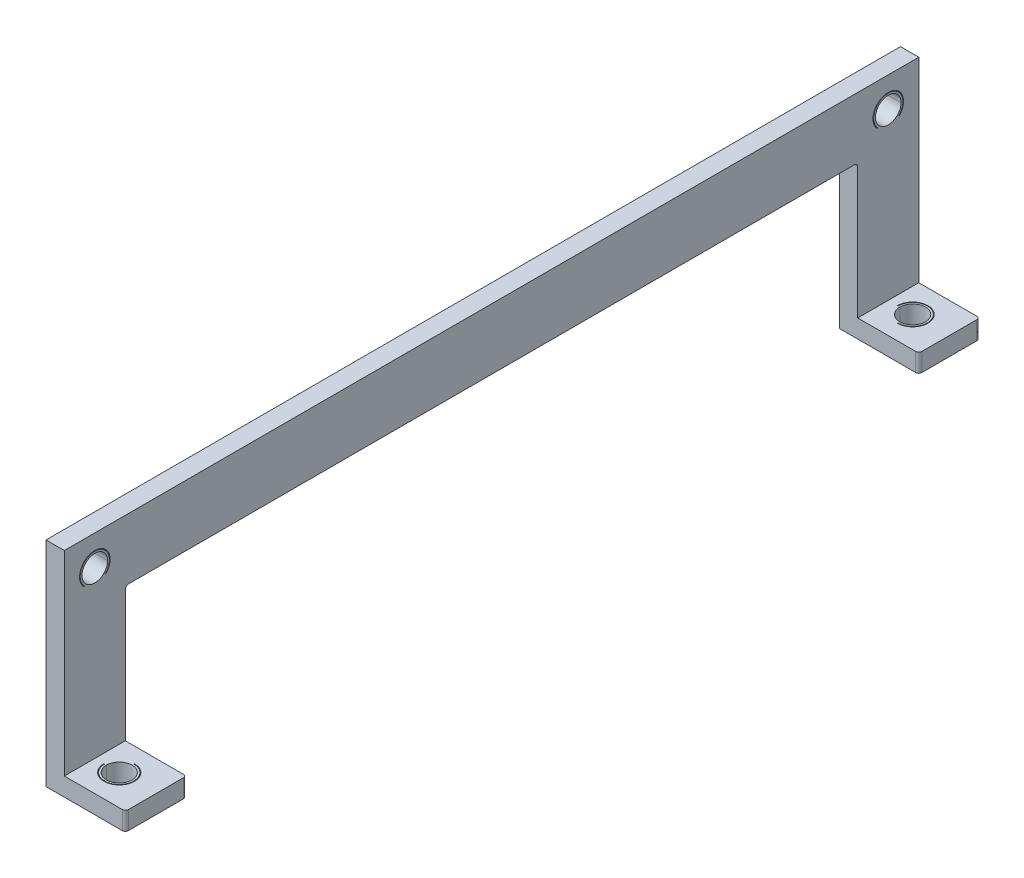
ISO-10303-21;
HEADER;
FILE_DESCRIPTION(('STEP AP214'),'2;1');
FILE_NAME('part.step','',(''),(''),'','','');
FILE_SCHEMA(('AUTOMOTIVE_DESIGN { 1 0 10303 214 1 1 1 1 }'));
ENDSEC;
DATA;
#1=APPLICATION_CONTEXT('core data for automotive mechanical design processes');
#2=APPLICATION_PROTOCOL_DEFINITION('international standard','automotive_design',2000,#1);
#3=PRODUCT_CONTEXT('',#1,'mechanical');
#4=PRODUCT('Part','Part','',(#3));
#5=PRODUCT_RELATED_PRODUCT_CATEGORY('part','',(#4));
#6=PRODUCT_DEFINITION_FORMATION('','',#4);
#7=PRODUCT_DEFINITION_CONTEXT('part definition',#1,'design');
#8=PRODUCT_DEFINITION('design','',#6,#7);
#9=PRODUCT_DEFINITION_SHAPE('','',#8);
#10=(LENGTH_UNIT() NAMED_UNIT(*) SI_UNIT(.MILLI.,.METRE.));
#11=(NAMED_UNIT(*) PLANE_ANGLE_UNIT() SI_UNIT($,.RADIAN.));
#12=(NAMED_UNIT(*) SI_UNIT($,.STERADIAN.) SOLID_ANGLE_UNIT());
#13=UNCERTAINTY_MEASURE_WITH_UNIT(LENGTH_MEASURE(1.E-05),#10,'distance_accuracy_value','');
#14=(GEOMETRIC_REPRESENTATION_CONTEXT(3) GLOBAL_UNCERTAINTY_ASSIGNED_CONTEXT((#13)) GLOBAL_UNIT_ASSIGNED_CONTEXT((#10,
#11,#12)) REPRESENTATION_CONTEXT('',''));
#15=CARTESIAN_POINT('',(0.,0.,0.));
#16=DIRECTION('',(0.,0.,1.));
#17=DIRECTION('',(1.,0.,0.));
#18=AXIS2_PLACEMENT_3D('',#15,#16,#17);
#19=CARTESIAN_POINT('',(-6.57372305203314,28.2322330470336,-66.7677669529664));
#20=DIRECTION('',(0.,0.707106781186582,-0.707106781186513));
#21=DIRECTION('',(-1.,0.,0.));
#22=AXIS2_PLACEMENT_3D('',#19,#20,#21);
#23=PLANE('',#22);
#24=DIRECTION('',(0.,-0.707106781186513,-0.707106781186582));
#25=VECTOR('',#24,1.);
#26=CARTESIAN_POINT('',(3.,82.5000000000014,-12.4999999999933));
#27=LINE('',#26,#25);
#28=CARTESIAN_POINT('',(3.,28.3029437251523,-66.6970562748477));
#29=VERTEX_POINT('',#28);
#30=CARTESIAN_POINT('',(3.,28.2322330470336,-66.7677669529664));
#31=VERTEX_POINT('',#30);
#32=EDGE_CURVE('E681',#29,#31,#27,.T.);
#33=ORIENTED_EDGE('',*,*,#32,.T.);
#34=DIRECTION('',(1.,0.,0.));
#35=VECTOR('',#34,1.);
#36=CARTESIAN_POINT('',(-6.57372305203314,28.2322330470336,-66.7677669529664));
#37=LINE('',#36,#35);
#38=CARTESIAN_POINT('',(0.,28.2322330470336,-66.7677669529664));
#39=VERTEX_POINT('',#38);
#40=EDGE_CURVE('E9',#39,#31,#37,.T.);
#41=ORIENTED_EDGE('',*,*,#40,.F.);
#42=DIRECTION('',(0.,0.707106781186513,0.707106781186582));
#43=VECTOR('',#42,1.);
#44=CARTESIAN_POINT('',(0.,28.2322330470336,-66.7677669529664));
#45=LINE('',#44,#43);
#46=CARTESIAN_POINT('',(0.,28.3029437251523,-66.6970562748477));
#47=VERTEX_POINT('',#46);
#48=EDGE_CURVE('E644',#39,#47,#45,.T.);
#49=ORIENTED_EDGE('',*,*,#48,.T.);
#50=DIRECTION('',(1.,0.,0.));
#51=VECTOR('',#50,1.);
#52=CARTESIAN_POINT('',(-6.57372305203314,28.3029437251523,-66.6970562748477));
#53=LINE('',#52,#51);
#54=EDGE_CURVE('E907',#47,#29,#53,.T.);
#55=ORIENTED_EDGE('',*,*,#54,.T.);
#56=EDGE_LOOP('',(#33,#41,#49,#55));
#57=FACE_BOUND('',#56,.T.);
#58=ADVANCED_FACE('F15',(#57),#23,.T.);
#59=CARTESIAN_POINT('',(-6.57372305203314,30.,-65.));
#60=DIRECTION('',(1.,0.,0.));
#61=DIRECTION('',(0.,0.,-1.));
#62=AXIS2_PLACEMENT_3D('',#59,#60,#61);
#63=CYLINDRICAL_SURFACE('',#62,2.5);
#64=DIRECTION('',(1.,0.,0.));
#65=VECTOR('',#64,1.);
#66=CARTESIAN_POINT('',(-6.57372305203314,30.,-67.5));
#67=LINE('',#66,#65);
#68=CARTESIAN_POINT('',(0.,30.,-67.5));
#69=VERTEX_POINT('',#68);
#70=CARTESIAN_POINT('',(3.,30.,-67.5));
#71=VERTEX_POINT('',#70);
#72=EDGE_CURVE('E1034',#69,#71,#67,.T.);
#73=ORIENTED_EDGE('',*,*,#72,.F.);
#74=CARTESIAN_POINT('',(0.,30.,-65.));
#75=DIRECTION('',(-1.,0.,0.));
#76=DIRECTION('',(0.,0.,1.));
#77=AXIS2_PLACEMENT_3D('',#74,#75,#76);
#78=CIRCLE('',#77,2.5);
#79=EDGE_CURVE('E651',#69,#39,#78,.T.);
#80=ORIENTED_EDGE('',*,*,#79,.T.);
#81=ORIENTED_EDGE('',*,*,#40,.T.);
#82=CARTESIAN_POINT('',(3.,30.,-65.));
#83=DIRECTION('',(1.,0.,0.));
#84=DIRECTION('',(0.,0.,1.));
#85=AXIS2_PLACEMENT_3D('',#82,#83,#84);
#86=CIRCLE('',#85,2.5);
#87=EDGE_CURVE('E586',#31,#71,#86,.T.);
#88=ORIENTED_EDGE('',*,*,#87,.T.);
#89=EDGE_LOOP('',(#73,#80,#81,#88));
#90=FACE_BOUND('',#89,.T.);
#91=ADVANCED_FACE('F1022',(#90),#63,.F.);
#92=CARTESIAN_POINT('',(-6.57372305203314,28.3029437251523,-63.3029437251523));
#93=DIRECTION('',(0.,0.707106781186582,0.707106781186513));
#94=DIRECTION('',(1.,0.,0.));
#95=AXIS2_PLACEMENT_3D('',#92,#93,#94);
#96=PLANE('',#95);
#97=DIRECTION('',(0.,0.707106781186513,-0.707106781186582));
#98=VECTOR('',#97,1.);
#99=CARTESIAN_POINT('',(3.,-52.4999999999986,17.5000000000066));
#100=LINE('',#99,#98);
#101=CARTESIAN_POINT('',(3.,28.2322330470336,-63.2322330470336));
#102=VERTEX_POINT('',#101);
#103=CARTESIAN_POINT('',(3.,28.3029437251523,-63.3029437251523));
#104=VERTEX_POINT('',#103);
#105=EDGE_CURVE('E589',#102,#104,#100,.T.);
#106=ORIENTED_EDGE('',*,*,#105,.T.);
#107=DIRECTION('',(1.,0.,0.));
#108=VECTOR('',#107,1.);
#109=CARTESIAN_POINT('',(-6.57372305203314,28.3029437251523,-63.3029437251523));
#110=LINE('',#109,#108);
#111=CARTESIAN_POINT('',(0.,28.3029437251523,-63.3029437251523));
#112=VERTEX_POINT('',#111);
#113=EDGE_CURVE('E24',#112,#104,#110,.T.);
#114=ORIENTED_EDGE('',*,*,#113,.F.);
#115=DIRECTION('',(0.,-0.707106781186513,0.707106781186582));
#116=VECTOR('',#115,1.);
#117=CARTESIAN_POINT('',(0.,28.3029437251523,-63.3029437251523));
#118=LINE('',#117,#116);
#119=CARTESIAN_POINT('',(0.,28.2322330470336,-63.2322330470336));
#120=VERTEX_POINT('',#119);
#121=EDGE_CURVE('E552',#112,#120,#118,.T.);
#122=ORIENTED_EDGE('',*,*,#121,.T.);
#123=DIRECTION('',(1.,0.,0.));
#124=VECTOR('',#123,1.);
#125=CARTESIAN_POINT('',(-6.57372305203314,28.2322330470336,-63.2322330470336));
#126=LINE('',#125,#124);
#127=EDGE_CURVE('E847',#120,#102,#126,.T.);
#128=ORIENTED_EDGE('',*,*,#127,.T.);
#129=EDGE_LOOP('',(#106,#114,#122,#128));
#130=FACE_BOUND('',#129,.T.);
#131=ADVANCED_FACE('F845',(#130),#96,.T.);
#132=CARTESIAN_POINT('',(-6.57372305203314,30.,-65.));
#133=DIRECTION('',(1.,0.,0.));
#134=DIRECTION('',(0.,0.,-1.));
#135=AXIS2_PLACEMENT_3D('',#132,#133,#134);
#136=CYLINDRICAL_SURFACE('',#135,2.4);
#137=DIRECTION('',(1.,0.,0.));
#138=VECTOR('',#137,1.);
#139=CARTESIAN_POINT('',(-6.57372305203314,30.,-62.6));
#140=LINE('',#139,#138);
#141=CARTESIAN_POINT('',(0.,30.,-62.6));
#142=VERTEX_POINT('',#141);
#143=CARTESIAN_POINT('',(3.,30.,-62.6));
#144=VERTEX_POINT('',#143);
#145=EDGE_CURVE('E862',#142,#144,#140,.T.);
#146=ORIENTED_EDGE('',*,*,#145,.F.);
#147=CARTESIAN_POINT('',(0.,30.,-65.));
#148=DIRECTION('',(-1.,0.,0.));
#149=DIRECTION('',(0.,0.,1.));
#150=AXIS2_PLACEMENT_3D('',#147,#148,#149);
#151=CIRCLE('',#150,2.4);
#152=EDGE_CURVE('E635',#112,#142,#151,.T.);
#153=ORIENTED_EDGE('',*,*,#152,.F.);
#154=ORIENTED_EDGE('',*,*,#113,.T.);
#155=CARTESIAN_POINT('',(3.,30.,-65.));
#156=DIRECTION('',(1.,0.,0.));
#157=DIRECTION('',(0.,0.,1.));
#158=AXIS2_PLACEMENT_3D('',#155,#156,#157);
#159=CIRCLE('',#158,2.4);
#160=EDGE_CURVE('E685',#144,#104,#159,.T.);
#161=ORIENTED_EDGE('',*,*,#160,.F.);
#162=EDGE_LOOP('',(#146,#153,#154,#161));
#163=FACE_BOUND('',#162,.T.);
#164=ADVANCED_FACE('F840',(#163),#136,.T.);
#165=CARTESIAN_POINT('',(-6.57372305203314,28.3029437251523,66.6970562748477));
#166=DIRECTION('',(0.,0.707106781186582,0.707106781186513));
#167=DIRECTION('',(1.,0.,0.));
#168=AXIS2_PLACEMENT_3D('',#165,#166,#167);
#169=PLANE('',#168);
#170=DIRECTION('',(0.,-0.707106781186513,0.707106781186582));
#171=VECTOR('',#170,1.);
#172=CARTESIAN_POINT('',(0.,28.3029437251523,66.6970562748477));
#173=LINE('',#172,#171);
#174=CARTESIAN_POINT('',(0.,28.3029437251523,66.6970562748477));
#175=VERTEX_POINT('',#174);
#176=CARTESIAN_POINT('',(0.,28.2322330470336,66.7677669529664));
#177=VERTEX_POINT('',#176);
#178=EDGE_CURVE('E551',#175,#177,#173,.T.);
#179=ORIENTED_EDGE('',*,*,#178,.T.);
#180=DIRECTION('',(1.,0.,0.));
#181=VECTOR('',#180,1.);
#182=CARTESIAN_POINT('',(-6.57372305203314,28.2322330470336,66.7677669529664));
#183=LINE('',#182,#181);
#184=CARTESIAN_POINT('',(3.,28.2322330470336,66.7677669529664));
#185=VERTEX_POINT('',#184);
#186=EDGE_CURVE('E951',#177,#185,#183,.T.);
#187=ORIENTED_EDGE('',*,*,#186,.T.);
#188=DIRECTION('',(0.,-0.707106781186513,0.707106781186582));
#189=VECTOR('',#188,1.);
#190=CARTESIAN_POINT('',(3.,28.3029437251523,66.6970562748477));
#191=LINE('',#190,#189);
#192=CARTESIAN_POINT('',(3.,28.3029437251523,66.6970562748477));
#193=VERTEX_POINT('',#192);
#194=EDGE_CURVE('E510',#193,#185,#191,.T.);
#195=ORIENTED_EDGE('',*,*,#194,.F.);
#196=DIRECTION('',(1.,0.,0.));
#197=VECTOR('',#196,1.);
#198=CARTESIAN_POINT('',(-6.57372305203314,28.3029437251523,66.6970562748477));
#199=LINE('',#198,#197);
#200=EDGE_CURVE('E833',#175,#193,#199,.T.);
#201=ORIENTED_EDGE('',*,*,#200,.F.);
#202=EDGE_LOOP('',(#179,#187,#195,#201));
#203=FACE_BOUND('',#202,.T.);
#204=ADVANCED_FACE('F1008',(#203),#169,.T.);
#205=CARTESIAN_POINT('',(-6.57372305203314,30.,65.));
#206=DIRECTION('',(1.,0.,0.));
#207=DIRECTION('',(0.,0.,-1.));
#208=AXIS2_PLACEMENT_3D('',#205,#206,#207);
#209=CYLINDRICAL_SURFACE('',#208,2.4);
#210=DIRECTION('',(1.,0.,0.));
#211=VECTOR('',#210,1.);
#212=CARTESIAN_POINT('',(-6.57372305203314,30.,67.4));
#213=LINE('',#212,#211);
#214=CARTESIAN_POINT('',(0.,30.,67.4));
#215=VERTEX_POINT('',#214);
#216=CARTESIAN_POINT('',(3.,30.,67.4));
#217=VERTEX_POINT('',#216);
#218=EDGE_CURVE('E906',#215,#217,#213,.T.);
#219=ORIENTED_EDGE('',*,*,#218,.F.);
#220=CARTESIAN_POINT('',(0.,30.,65.));
#221=DIRECTION('',(1.,0.,0.));
#222=DIRECTION('',(0.,0.,1.));
#223=AXIS2_PLACEMENT_3D('',#220,#221,#222);
#224=CIRCLE('',#223,2.4);
#225=EDGE_CURVE('E557',#215,#175,#224,.T.);
#226=ORIENTED_EDGE('',*,*,#225,.T.);
#227=ORIENTED_EDGE('',*,*,#200,.T.);
#228=CARTESIAN_POINT('',(3.,30.,65.));
#229=DIRECTION('',(1.,0.,0.));
#230=DIRECTION('',(0.,0.,-1.));
#231=AXIS2_PLACEMENT_3D('',#228,#229,#230);
#232=CIRCLE('',#231,2.4);
#233=EDGE_CURVE('E464',#217,#193,#232,.T.);
#234=ORIENTED_EDGE('',*,*,#233,.F.);
#235=EDGE_LOOP('',(#219,#226,#227,#234));
#236=FACE_BOUND('',#235,.T.);
#237=ADVANCED_FACE('F1009',(#236),#209,.T.);
#238=CARTESIAN_POINT('',(-6.57372305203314,28.2322330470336,63.2322330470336));
#239=DIRECTION('',(0.,0.707106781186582,-0.707106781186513));
#240=DIRECTION('',(-1.,0.,0.));
#241=AXIS2_PLACEMENT_3D('',#238,#239,#240);
#242=PLANE('',#241);
#243=DIRECTION('',(0.,0.707106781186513,0.707106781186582));
#244=VECTOR('',#243,1.);
#245=CARTESIAN_POINT('',(0.,28.2322330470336,63.2322330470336));
#246=LINE('',#245,#244);
#247=CARTESIAN_POINT('',(0.,28.2322330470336,63.2322330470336));
#248=VERTEX_POINT('',#247);
#249=CARTESIAN_POINT('',(0.,28.3029437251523,63.3029437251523));
#250=VERTEX_POINT('',#249);
#251=EDGE_CURVE('E561',#248,#250,#246,.T.);
#252=ORIENTED_EDGE('',*,*,#251,.T.);
#253=DIRECTION('',(1.,0.,0.));
#254=VECTOR('',#253,1.);
#255=CARTESIAN_POINT('',(-6.57372305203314,28.3029437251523,63.3029437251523));
#256=LINE('',#255,#254);
#257=CARTESIAN_POINT('',(3.,28.3029437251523,63.3029437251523));
#258=VERTEX_POINT('',#257);
#259=EDGE_CURVE('E930',#250,#258,#256,.T.);
#260=ORIENTED_EDGE('',*,*,#259,.T.);
#261=DIRECTION('',(0.,0.707106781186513,0.707106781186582));
#262=VECTOR('',#261,1.);
#263=CARTESIAN_POINT('',(3.,28.2322330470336,63.2322330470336));
#264=LINE('',#263,#262);
#265=CARTESIAN_POINT('',(3.,28.2322330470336,63.2322330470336));
#266=VERTEX_POINT('',#265);
#267=EDGE_CURVE('E509',#266,#258,#264,.T.);
#268=ORIENTED_EDGE('',*,*,#267,.F.);
#269=DIRECTION('',(1.,0.,0.));
#270=VECTOR('',#269,1.);
#271=CARTESIAN_POINT('',(-6.57372305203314,28.2322330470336,63.2322330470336));
#272=LINE('',#271,#270);
#273=EDGE_CURVE('E830',#248,#266,#272,.T.);
#274=ORIENTED_EDGE('',*,*,#273,.F.);
#275=EDGE_LOOP('',(#252,#260,#268,#274));
#276=FACE_BOUND('',#275,.T.);
#277=ADVANCED_FACE('F997',(#276),#242,.T.);
#278=CARTESIAN_POINT('',(-6.57372305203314,30.,65.));
#279=DIRECTION('',(1.,0.,0.));
#280=DIRECTION('',(0.,0.,-1.));
#281=AXIS2_PLACEMENT_3D('',#278,#279,#280);
#282=CYLINDRICAL_SURFACE('',#281,2.5);
#283=DIRECTION('',(1.,0.,0.));
#284=VECTOR('',#283,1.);
#285=CARTESIAN_POINT('',(-6.57372305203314,30.,62.5));
#286=LINE('',#285,#284);
#287=CARTESIAN_POINT('',(0.,30.,62.5));
#288=VERTEX_POINT('',#287);
#289=CARTESIAN_POINT('',(3.,30.,62.5));
#290=VERTEX_POINT('',#289);
#291=EDGE_CURVE('E961',#288,#290,#286,.T.);
#292=ORIENTED_EDGE('',*,*,#291,.F.);
#293=CARTESIAN_POINT('',(0.,30.,65.));
#294=DIRECTION('',(1.,0.,0.));
#295=DIRECTION('',(0.,0.,1.));
#296=AXIS2_PLACEMENT_3D('',#293,#294,#295);
#297=CIRCLE('',#296,2.5);
#298=EDGE_CURVE('E548',#248,#288,#297,.T.);
#299=ORIENTED_EDGE('',*,*,#298,.F.);
#300=ORIENTED_EDGE('',*,*,#273,.T.);
#301=CARTESIAN_POINT('',(3.,30.,65.));
#302=DIRECTION('',(1.,0.,0.));
#303=DIRECTION('',(0.,0.,-1.));
#304=AXIS2_PLACEMENT_3D('',#301,#302,#303);
#305=CIRCLE('',#304,2.5);
#306=EDGE_CURVE('E506',#266,#290,#305,.T.);
#307=ORIENTED_EDGE('',*,*,#306,.T.);
#308=EDGE_LOOP('',(#292,#299,#300,#307));
#309=FACE_BOUND('',#308,.T.);
#310=ADVANCED_FACE('F992',(#309),#282,.F.);
#311=CARTESIAN_POINT('',(-5.93969696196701,30.,-65.));
#312=DIRECTION('',(1.,0.,0.));
#313=DIRECTION('',(0.,0.,-1.));
#314=AXIS2_PLACEMENT_3D('',#311,#312,#313);
#315=CYLINDRICAL_SURFACE('',#314,2.1);
#316=DIRECTION('',(1.,0.,0.));
#317=VECTOR('',#316,1.);
#318=CARTESIAN_POINT('',(-5.93969696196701,30.,-62.9));
#319=LINE('',#318,#317);
#320=CARTESIAN_POINT('',(0.,30.,-62.9));
#321=VERTEX_POINT('',#320);
#322=CARTESIAN_POINT('',(3.,30.,-62.9));
#323=VERTEX_POINT('',#322);
#324=EDGE_CURVE('E456',#321,#323,#319,.T.);
#325=ORIENTED_EDGE('',*,*,#324,.F.);
#326=CARTESIAN_POINT('',(0.,30.,-65.));
#327=DIRECTION('',(1.,0.,0.));
#328=DIRECTION('',(0.,0.,1.));
#329=AXIS2_PLACEMENT_3D('',#326,#327,#328);
#330=CIRCLE('',#329,2.1);
#331=CARTESIAN_POINT('',(0.,30.,-67.1));
#332=VERTEX_POINT('',#331);
#333=EDGE_CURVE('E745',#332,#321,#330,.T.);
#334=ORIENTED_EDGE('',*,*,#333,.F.);
#335=DIRECTION('',(1.,0.,0.));
#336=VECTOR('',#335,1.);
#337=CARTESIAN_POINT('',(-5.93969696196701,30.,-67.1));
#338=LINE('',#337,#336);
#339=CARTESIAN_POINT('',(3.,30.,-67.1));
#340=VERTEX_POINT('',#339);
#341=EDGE_CURVE('E459',#332,#340,#338,.T.);
#342=ORIENTED_EDGE('',*,*,#341,.T.);
#343=CARTESIAN_POINT('',(3.,30.,-65.));
#344=DIRECTION('',(1.,0.,0.));
#345=DIRECTION('',(0.,0.,1.));
#346=AXIS2_PLACEMENT_3D('',#343,#344,#345);
#347=CIRCLE('',#346,2.1);
#348=EDGE_CURVE('E452',#340,#323,#347,.T.);
#349=ORIENTED_EDGE('',*,*,#348,.T.);
#350=EDGE_LOOP('',(#325,#334,#342,#349));
#351=FACE_BOUND('',#350,.T.);
#352=ADVANCED_FACE('F454',(#351),#315,.F.);
#353=CARTESIAN_POINT('',(-5.93969696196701,30.,65.));
#354=DIRECTION('',(1.,0.,0.));
#355=DIRECTION('',(0.,0.,-1.));
#356=AXIS2_PLACEMENT_3D('',#353,#354,#355);
#357=CYLINDRICAL_SURFACE('',#356,2.1);
#358=DIRECTION('',(1.,0.,0.));
#359=VECTOR('',#358,1.);
#360=CARTESIAN_POINT('',(-5.93969696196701,30.,67.1));
#361=LINE('',#360,#359);
#362=CARTESIAN_POINT('',(0.,30.,67.1));
#363=VERTEX_POINT('',#362);
#364=CARTESIAN_POINT('',(3.,30.,67.1));
#365=VERTEX_POINT('',#364);
#366=EDGE_CURVE('E487',#363,#365,#361,.T.);
#367=ORIENTED_EDGE('',*,*,#366,.F.);
#368=CARTESIAN_POINT('',(0.,30.,65.));
#369=DIRECTION('',(1.,0.,0.));
#370=DIRECTION('',(0.,0.,1.));
#371=AXIS2_PLACEMENT_3D('',#368,#369,#370);
#372=CIRCLE('',#371,2.1);
#373=CARTESIAN_POINT('',(0.,30.,62.9));
#374=VERTEX_POINT('',#373);
#375=EDGE_CURVE('E748',#374,#363,#372,.T.);
#376=ORIENTED_EDGE('',*,*,#375,.F.);
#377=DIRECTION('',(1.,0.,0.));
#378=VECTOR('',#377,1.);
#379=CARTESIAN_POINT('',(-5.93969696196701,30.,62.9));
#380=LINE('',#379,#378);
#381=CARTESIAN_POINT('',(3.,30.,62.9));
#382=VERTEX_POINT('',#381);
#383=EDGE_CURVE('E501',#374,#382,#380,.T.);
#384=ORIENTED_EDGE('',*,*,#383,.T.);
#385=CARTESIAN_POINT('',(3.,30.,65.));
#386=DIRECTION('',(1.,0.,0.));
#387=DIRECTION('',(0.,0.,-1.));
#388=AXIS2_PLACEMENT_3D('',#385,#386,#387);
#389=CIRCLE('',#388,2.1);
#390=EDGE_CURVE('E463',#382,#365,#389,.T.);
#391=ORIENTED_EDGE('',*,*,#390,.T.);
#392=EDGE_LOOP('',(#367,#376,#384,#391));
#393=FACE_BOUND('',#392,.T.);
#394=ADVANCED_FACE('F1164',(#393),#357,.F.);
#395=CARTESIAN_POINT('',(7.,-7.07106781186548,-62.5));
#396=DIRECTION('',(1.,0.,0.));
#397=DIRECTION('',(0.,0.,-1.));
#398=AXIS2_PLACEMENT_3D('',#395,#396,#397);
#399=PLANE('',#398);
#400=DIRECTION('',(0.,0.,-1.));
#401=VECTOR('',#400,1.);
#402=CARTESIAN_POINT('',(7.,0.,-62.5));
#403=LINE('',#402,#401);
#404=CARTESIAN_POINT('',(7.,0.,-62.5));
#405=VERTEX_POINT('',#404);
#406=CARTESIAN_POINT('',(7.,0.,-62.6));
#407=VERTEX_POINT('',#406);
#408=EDGE_CURVE('E597',#405,#407,#403,.T.);
#409=ORIENTED_EDGE('',*,*,#408,.T.);
#410=DIRECTION('',(0.,1.,0.));
#411=VECTOR('',#410,1.);
#412=CARTESIAN_POINT('',(7.,-7.07106781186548,-62.6));
#413=LINE('',#412,#411);
#414=CARTESIAN_POINT('',(7.,3.,-62.6));
#415=VERTEX_POINT('',#414);
#416=EDGE_CURVE('E821',#407,#415,#413,.T.);
#417=ORIENTED_EDGE('',*,*,#416,.T.);
#418=DIRECTION('',(0.,0.,-1.));
#419=VECTOR('',#418,1.);
#420=CARTESIAN_POINT('',(7.,3.,-62.5));
#421=LINE('',#420,#419);
#422=CARTESIAN_POINT('',(7.,3.,-62.5));
#423=VERTEX_POINT('',#422);
#424=EDGE_CURVE('E524',#423,#415,#421,.T.);
#425=ORIENTED_EDGE('',*,*,#424,.F.);
#426=DIRECTION('',(0.,1.,0.));
#427=VECTOR('',#426,1.);
#428=CARTESIAN_POINT('',(7.,-7.07106781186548,-62.5));
#429=LINE('',#428,#427);
#430=EDGE_CURVE('E827',#405,#423,#429,.T.);
#431=ORIENTED_EDGE('',*,*,#430,.F.);
#432=EDGE_LOOP('',(#409,#417,#425,#431));
#433=FACE_BOUND('',#432,.T.);
#434=ADVANCED_FACE('F1078',(#433),#399,.T.);
#435=CARTESIAN_POINT('',(7.,-7.07106781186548,-65.));
#436=DIRECTION('',(0.,1.,0.));
#437=DIRECTION('',(-1.,0.,0.));
#438=AXIS2_PLACEMENT_3D('',#435,#436,#437);
#439=CYLINDRICAL_SURFACE('',#438,2.5);
#440=CARTESIAN_POINT('',(7.,0.,-65.));
#441=DIRECTION('',(0.,-1.,0.));
#442=DIRECTION('',(1.,0.,0.));
#443=AXIS2_PLACEMENT_3D('',#440,#441,#442);
#444=CIRCLE('',#443,2.5);
#445=CARTESIAN_POINT('',(4.5,0.,-65.));
#446=VERTEX_POINT('',#445);
#447=EDGE_CURVE('E592',#446,#405,#444,.T.);
#448=ORIENTED_EDGE('',*,*,#447,.T.);
#449=ORIENTED_EDGE('',*,*,#430,.T.);
#450=CARTESIAN_POINT('',(7.,3.,-65.));
#451=DIRECTION('',(0.,-1.,0.));
#452=DIRECTION('',(1.,0.,0.));
#453=AXIS2_PLACEMENT_3D('',#450,#451,#452);
#454=CIRCLE('',#453,2.5);
#455=CARTESIAN_POINT('',(4.5,3.,-65.));
#456=VERTEX_POINT('',#455);
#457=EDGE_CURVE('E778',#456,#423,#454,.T.);
#458=ORIENTED_EDGE('',*,*,#457,.F.);
#459=DIRECTION('',(0.,1.,0.));
#460=VECTOR('',#459,1.);
#461=CARTESIAN_POINT('',(4.5,-7.07106781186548,-65.));
#462=LINE('',#461,#460);
#463=EDGE_CURVE('E37',#446,#456,#462,.T.);
#464=ORIENTED_EDGE('',*,*,#463,.F.);
#465=EDGE_LOOP('',(#448,#449,#458,#464));
#466=FACE_BOUND('',#465,.T.);
#467=ADVANCED_FACE('F1087',(#466),#439,.F.);
#468=CARTESIAN_POINT('',(4.6,-7.07106781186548,-65.));
#469=DIRECTION('',(0.,0.,-1.));
#470=DIRECTION('',(0.,-1.,0.));
#471=AXIS2_PLACEMENT_3D('',#468,#469,#470);
#472=PLANE('',#471);
#473=DIRECTION('',(-1.,0.,0.));
#474=VECTOR('',#473,1.);
#475=CARTESIAN_POINT('',(4.6,0.,-65.));
#476=LINE('',#475,#474);
#477=CARTESIAN_POINT('',(4.6,0.,-65.));
#478=VERTEX_POINT('',#477);
#479=EDGE_CURVE('E596',#478,#446,#476,.T.);
#480=ORIENTED_EDGE('',*,*,#479,.T.);
#481=ORIENTED_EDGE('',*,*,#463,.T.);
#482=DIRECTION('',(-1.,0.,0.));
#483=VECTOR('',#482,1.);
#484=CARTESIAN_POINT('',(4.6,3.,-65.));
#485=LINE('',#484,#483);
#486=CARTESIAN_POINT('',(4.6,3.,-65.));
#487=VERTEX_POINT('',#486);
#488=EDGE_CURVE('E523',#487,#456,#485,.T.);
#489=ORIENTED_EDGE('',*,*,#488,.F.);
#490=DIRECTION('',(0.,1.,0.));
#491=VECTOR('',#490,1.);
#492=CARTESIAN_POINT('',(4.6,-7.07106781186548,-65.));
#493=LINE('',#492,#491);
#494=EDGE_CURVE('E818',#478,#487,#493,.T.);
#495=ORIENTED_EDGE('',*,*,#494,.F.);
#496=EDGE_LOOP('',(#480,#481,#489,#495));
#497=FACE_BOUND('',#496,.T.);
#498=ADVANCED_FACE('F1084',(#497),#472,.T.);
#499=CARTESIAN_POINT('',(7.,-7.07106781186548,-65.));
#500=DIRECTION('',(0.,1.,0.));
#501=DIRECTION('',(-1.,0.,0.));
#502=AXIS2_PLACEMENT_3D('',#499,#500,#501);
#503=CYLINDRICAL_SURFACE('',#502,2.4);
#504=ORIENTED_EDGE('',*,*,#494,.T.);
#505=CARTESIAN_POINT('',(7.,3.,-65.));
#506=DIRECTION('',(0.,-1.,0.));
#507=DIRECTION('',(1.,0.,0.));
#508=AXIS2_PLACEMENT_3D('',#505,#506,#507);
#509=CIRCLE('',#508,2.4);
#510=EDGE_CURVE('E519',#487,#415,#509,.T.);
#511=ORIENTED_EDGE('',*,*,#510,.T.);
#512=ORIENTED_EDGE('',*,*,#416,.F.);
#513=CARTESIAN_POINT('',(7.,0.,-65.));
#514=DIRECTION('',(0.,-1.,0.));
#515=DIRECTION('',(1.,0.,0.));
#516=AXIS2_PLACEMENT_3D('',#513,#514,#515);
#517=CIRCLE('',#516,2.4);
#518=EDGE_CURVE('E689',#478,#407,#517,.T.);
#519=ORIENTED_EDGE('',*,*,#518,.F.);
#520=EDGE_LOOP('',(#504,#511,#512,#519));
#521=FACE_BOUND('',#520,.T.);
#522=ADVANCED_FACE('F1082',(#521),#503,.T.);
#523=CARTESIAN_POINT('',(7.,-7.07106781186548,62.6));
#524=DIRECTION('',(1.,0.,0.));
#525=DIRECTION('',(0.,-1.,0.));
#526=AXIS2_PLACEMENT_3D('',#523,#524,#525);
#527=PLANE('',#526);
#528=DIRECTION('',(0.,0.,-1.));
#529=VECTOR('',#528,1.);
#530=CARTESIAN_POINT('',(7.,0.,62.6));
#531=LINE('',#530,#529);
#532=CARTESIAN_POINT('',(7.,0.,62.6));
#533=VERTEX_POINT('',#532);
#534=CARTESIAN_POINT('',(7.,0.,62.5));
#535=VERTEX_POINT('',#534);
#536=EDGE_CURVE('E492',#533,#535,#531,.T.);
#537=ORIENTED_EDGE('',*,*,#536,.T.);
#538=DIRECTION('',(0.,1.,0.));
#539=VECTOR('',#538,1.);
#540=CARTESIAN_POINT('',(7.,-7.07106781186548,62.5));
#541=LINE('',#540,#539);
#542=CARTESIAN_POINT('',(7.,3.,62.5));
#543=VERTEX_POINT('',#542);
#544=EDGE_CURVE('E809',#535,#543,#541,.T.);
#545=ORIENTED_EDGE('',*,*,#544,.T.);
#546=DIRECTION('',(0.,0.,-1.));
#547=VECTOR('',#546,1.);
#548=CARTESIAN_POINT('',(7.,3.,62.6));
#549=LINE('',#548,#547);
#550=CARTESIAN_POINT('',(7.,3.,62.6));
#551=VERTEX_POINT('',#550);
#552=EDGE_CURVE('E627',#551,#543,#549,.T.);
#553=ORIENTED_EDGE('',*,*,#552,.F.);
#554=DIRECTION('',(0.,1.,0.));
#555=VECTOR('',#554,1.);
#556=CARTESIAN_POINT('',(7.,-7.07106781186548,62.6));
#557=LINE('',#556,#555);
#558=EDGE_CURVE('E815',#533,#551,#557,.T.);
#559=ORIENTED_EDGE('',*,*,#558,.F.);
#560=EDGE_LOOP('',(#537,#545,#553,#559));
#561=FACE_BOUND('',#560,.T.);
#562=ADVANCED_FACE('F1093',(#561),#527,.T.);
#563=CARTESIAN_POINT('',(7.,-7.07106781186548,65.));
#564=DIRECTION('',(0.,1.,0.));
#565=DIRECTION('',(-1.,0.,0.));
#566=AXIS2_PLACEMENT_3D('',#563,#564,#565);
#567=CYLINDRICAL_SURFACE('',#566,2.4);
#568=CARTESIAN_POINT('',(7.,0.,65.));
#569=DIRECTION('',(0.,1.,0.));
#570=DIRECTION('',(1.,0.,0.));
#571=AXIS2_PLACEMENT_3D('',#568,#569,#570);
#572=CIRCLE('',#571,2.4);
#573=CARTESIAN_POINT('',(4.6,0.,65.));
#574=VERTEX_POINT('',#573);
#575=EDGE_CURVE('E496',#574,#533,#572,.T.);
#576=ORIENTED_EDGE('',*,*,#575,.T.);
#577=ORIENTED_EDGE('',*,*,#558,.T.);
#578=CARTESIAN_POINT('',(7.,3.,65.));
#579=DIRECTION('',(0.,1.,0.));
#580=DIRECTION('',(1.,0.,0.));
#581=AXIS2_PLACEMENT_3D('',#578,#579,#580);
#582=CIRCLE('',#581,2.4);
#583=CARTESIAN_POINT('',(4.6,3.,65.));
#584=VERTEX_POINT('',#583);
#585=EDGE_CURVE('E641',#584,#551,#582,.T.);
#586=ORIENTED_EDGE('',*,*,#585,.F.);
#587=DIRECTION('',(0.,1.,0.));
#588=VECTOR('',#587,1.);
#589=CARTESIAN_POINT('',(4.6,-7.07106781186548,65.));
#590=LINE('',#589,#588);
#591=EDGE_CURVE('E812',#574,#584,#590,.T.);
#592=ORIENTED_EDGE('',*,*,#591,.F.);
#593=EDGE_LOOP('',(#576,#577,#586,#592));
#594=FACE_BOUND('',#593,.T.);
#595=ADVANCED_FACE('F1154',(#594),#567,.T.);
#596=CARTESIAN_POINT('',(4.5,-7.07106781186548,65.));
#597=DIRECTION('',(0.,0.,1.));
#598=DIRECTION('',(1.,0.,0.));
#599=AXIS2_PLACEMENT_3D('',#596,#597,#598);
#600=PLANE('',#599);
#601=DIRECTION('',(1.,0.,0.));
#602=VECTOR('',#601,1.);
#603=CARTESIAN_POINT('',(4.5,0.,65.));
#604=LINE('',#603,#602);
#605=CARTESIAN_POINT('',(4.5,0.,65.));
#606=VERTEX_POINT('',#605);
#607=EDGE_CURVE('E601',#606,#574,#604,.T.);
#608=ORIENTED_EDGE('',*,*,#607,.T.);
#609=ORIENTED_EDGE('',*,*,#591,.T.);
#610=DIRECTION('',(1.,0.,0.));
#611=VECTOR('',#610,1.);
#612=CARTESIAN_POINT('',(4.5,3.,65.));
#613=LINE('',#612,#611);
#614=CARTESIAN_POINT('',(4.5,3.,65.));
#615=VERTEX_POINT('',#614);
#616=EDGE_CURVE('E637',#615,#584,#613,.T.);
#617=ORIENTED_EDGE('',*,*,#616,.F.);
#618=DIRECTION('',(0.,1.,0.));
#619=VECTOR('',#618,1.);
#620=CARTESIAN_POINT('',(4.5,-7.07106781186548,65.));
#621=LINE('',#620,#619);
#622=EDGE_CURVE('E806',#606,#615,#621,.T.);
#623=ORIENTED_EDGE('',*,*,#622,.F.);
#624=EDGE_LOOP('',(#608,#609,#617,#623));
#625=FACE_BOUND('',#624,.T.);
#626=ADVANCED_FACE('F1150',(#625),#600,.T.);
#627=CARTESIAN_POINT('',(7.,-7.07106781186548,65.));
#628=DIRECTION('',(0.,1.,0.));
#629=DIRECTION('',(-1.,0.,0.));
#630=AXIS2_PLACEMENT_3D('',#627,#628,#629);
#631=CYLINDRICAL_SURFACE('',#630,2.5);
#632=ORIENTED_EDGE('',*,*,#622,.T.);
#633=CARTESIAN_POINT('',(7.,3.,65.));
#634=DIRECTION('',(0.,1.,0.));
#635=DIRECTION('',(-1.,0.,0.));
#636=AXIS2_PLACEMENT_3D('',#633,#634,#635);
#637=CIRCLE('',#636,2.5);
#638=EDGE_CURVE('E631',#615,#543,#637,.T.);
#639=ORIENTED_EDGE('',*,*,#638,.T.);
#640=ORIENTED_EDGE('',*,*,#544,.F.);
#641=CARTESIAN_POINT('',(7.,0.,65.));
#642=DIRECTION('',(0.,1.,0.));
#643=DIRECTION('',(1.,0.,0.));
#644=AXIS2_PLACEMENT_3D('',#641,#642,#643);
#645=CIRCLE('',#644,2.5);
#646=EDGE_CURVE('E497',#606,#535,#645,.T.);
#647=ORIENTED_EDGE('',*,*,#646,.F.);
#648=EDGE_LOOP('',(#632,#639,#640,#647));
#649=FACE_BOUND('',#648,.T.);
#650=ADVANCED_FACE('F1146',(#649),#631,.F.);
#651=CARTESIAN_POINT('',(7.,-5.93969696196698,65.));
#652=DIRECTION('',(0.,1.,0.));
#653=DIRECTION('',(-1.,0.,0.));
#654=AXIS2_PLACEMENT_3D('',#651,#652,#653);
#655=CYLINDRICAL_SURFACE('',#654,2.1);
#656=DIRECTION('',(0.,1.,0.));
#657=VECTOR('',#656,1.);
#658=CARTESIAN_POINT('',(9.1,-5.93969696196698,65.));
#659=LINE('',#658,#657);
#660=CARTESIAN_POINT('',(9.1,0.,65.));
#661=VERTEX_POINT('',#660);
#662=CARTESIAN_POINT('',(9.1,3.,65.));
#663=VERTEX_POINT('',#662);
#664=EDGE_CURVE('E514',#661,#663,#659,.T.);
#665=ORIENTED_EDGE('',*,*,#664,.F.);
#666=CARTESIAN_POINT('',(7.,0.,65.));
#667=DIRECTION('',(0.,1.,0.));
#668=DIRECTION('',(1.,0.,0.));
#669=AXIS2_PLACEMENT_3D('',#666,#667,#668);
#670=CIRCLE('',#669,2.1);
#671=CARTESIAN_POINT('',(4.9,0.,65.));
#672=VERTEX_POINT('',#671);
#673=EDGE_CURVE('E605',#672,#661,#670,.T.);
#674=ORIENTED_EDGE('',*,*,#673,.F.);
#675=DIRECTION('',(0.,1.,0.));
#676=VECTOR('',#675,1.);
#677=CARTESIAN_POINT('',(4.9,-5.93969696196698,65.));
#678=LINE('',#677,#676);
#679=CARTESIAN_POINT('',(4.9,3.,65.));
#680=VERTEX_POINT('',#679);
#681=EDGE_CURVE('E533',#672,#680,#678,.T.);
#682=ORIENTED_EDGE('',*,*,#681,.T.);
#683=CARTESIAN_POINT('',(7.,3.,65.));
#684=DIRECTION('',(0.,1.,0.));
#685=DIRECTION('',(-1.,0.,0.));
#686=AXIS2_PLACEMENT_3D('',#683,#684,#685);
#687=CIRCLE('',#686,2.1);
#688=EDGE_CURVE('E648',#680,#663,#687,.T.);
#689=ORIENTED_EDGE('',*,*,#688,.T.);
#690=EDGE_LOOP('',(#665,#674,#682,#689));
#691=FACE_BOUND('',#690,.T.);
#692=ADVANCED_FACE('F1143',(#691),#655,.F.);
#693=CARTESIAN_POINT('',(7.,-5.93969696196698,-65.));
#694=DIRECTION('',(0.,1.,0.));
#695=DIRECTION('',(-1.,0.,0.));
#696=AXIS2_PLACEMENT_3D('',#693,#694,#695);
#697=CYLINDRICAL_SURFACE('',#696,2.1);
#698=DIRECTION('',(0.,1.,0.));
#699=VECTOR('',#698,1.);
#700=CARTESIAN_POINT('',(9.1,-5.93969696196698,-65.));
#701=LINE('',#700,#699);
#702=CARTESIAN_POINT('',(9.1,0.,-65.));
#703=VERTEX_POINT('',#702);
#704=CARTESIAN_POINT('',(9.1,3.,-65.));
#705=VERTEX_POINT('',#704);
#706=EDGE_CURVE('E547',#703,#705,#701,.T.);
#707=ORIENTED_EDGE('',*,*,#706,.F.);
#708=CARTESIAN_POINT('',(7.,0.,-65.));
#709=DIRECTION('',(0.,1.,0.));
#710=DIRECTION('',(1.,0.,0.));
#711=AXIS2_PLACEMENT_3D('',#708,#709,#710);
#712=CIRCLE('',#711,2.1);
#713=CARTESIAN_POINT('',(4.9,0.,-65.));
#714=VERTEX_POINT('',#713);
#715=EDGE_CURVE('E768',#714,#703,#712,.T.);
#716=ORIENTED_EDGE('',*,*,#715,.F.);
#717=DIRECTION('',(0.,1.,0.));
#718=VECTOR('',#717,1.);
#719=CARTESIAN_POINT('',(4.9,-5.93969696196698,-65.));
#720=LINE('',#719,#718);
#721=CARTESIAN_POINT('',(4.9,3.,-65.));
#722=VERTEX_POINT('',#721);
#723=EDGE_CURVE('E562',#714,#722,#720,.T.);
#724=ORIENTED_EDGE('',*,*,#723,.T.);
#725=CARTESIAN_POINT('',(7.,3.,-65.));
#726=DIRECTION('',(0.,1.,0.));
#727=DIRECTION('',(-1.,0.,0.));
#728=AXIS2_PLACEMENT_3D('',#725,#726,#727);
#729=CIRCLE('',#728,2.1);
#730=EDGE_CURVE('E782',#722,#705,#729,.T.);
#731=ORIENTED_EDGE('',*,*,#730,.T.);
#732=EDGE_LOOP('',(#707,#716,#724,#731));
#733=FACE_BOUND('',#732,.T.);
#734=ADVANCED_FACE('F1141',(#733),#697,.F.);
#735=CARTESIAN_POINT('',(12.5,3.,69.5));
#736=DIRECTION('',(0.,1.,0.));
#737=DIRECTION('',(0.,0.,1.));
#738=AXIS2_PLACEMENT_3D('',#735,#736,#737);
#739=CYLINDRICAL_SURFACE('',#738,0.5);
#740=CARTESIAN_POINT('',(12.5,3.,69.5));
#741=DIRECTION('',(0.,1.,0.));
#742=DIRECTION('',(1.,0.,0.));
#743=AXIS2_PLACEMENT_3D('',#740,#741,#742);
#744=CIRCLE('',#743,0.5);
#745=CARTESIAN_POINT('',(12.5,3.,70.));
#746=VERTEX_POINT('',#745);
#747=CARTESIAN_POINT('',(13.,3.,69.5));
#748=VERTEX_POINT('',#747);
#749=EDGE_CURVE('E217',#746,#748,#744,.T.);
#750=ORIENTED_EDGE('',*,*,#749,.F.);
#751=DIRECTION('',(0.,1.,0.));
#752=VECTOR('',#751,1.);
#753=CARTESIAN_POINT('',(12.5,3.,70.));
#754=LINE('',#753,#752);
#755=CARTESIAN_POINT('',(12.5,0.,70.));
#756=VERTEX_POINT('',#755);
#757=EDGE_CURVE('E785',#756,#746,#754,.T.);
#758=ORIENTED_EDGE('',*,*,#757,.F.);
#759=CARTESIAN_POINT('',(12.5,0.,69.5));
#760=DIRECTION('',(0.,-1.,0.));
#761=DIRECTION('',(1.,0.,0.));
#762=AXIS2_PLACEMENT_3D('',#759,#760,#761);
#763=CIRCLE('',#762,0.5);
#764=CARTESIAN_POINT('',(13.,0.,69.5));
#765=VERTEX_POINT('',#764);
#766=EDGE_CURVE('E577',#765,#756,#763,.T.);
#767=ORIENTED_EDGE('',*,*,#766,.F.);
#768=DIRECTION('',(0.,-1.,0.));
#769=VECTOR('',#768,1.);
#770=CARTESIAN_POINT('',(13.,0.,69.5));
#771=LINE('',#770,#769);
#772=EDGE_CURVE('E613',#748,#765,#771,.T.);
#773=ORIENTED_EDGE('',*,*,#772,.F.);
#774=EDGE_LOOP('',(#750,#758,#767,#773));
#775=FACE_BOUND('',#774,.T.);
#776=ADVANCED_FACE('F1138',(#775),#739,.T.);
#777=CARTESIAN_POINT('',(12.5,3.,60.5));
#778=DIRECTION('',(0.,-1.,0.));
#779=DIRECTION('',(0.,0.,-1.));
#780=AXIS2_PLACEMENT_3D('',#777,#778,#779);
#781=CYLINDRICAL_SURFACE('',#780,0.5);
#782=CARTESIAN_POINT('',(12.5,0.,60.5));
#783=DIRECTION('',(0.,-1.,0.));
#784=DIRECTION('',(1.,0.,0.));
#785=AXIS2_PLACEMENT_3D('',#782,#783,#784);
#786=CIRCLE('',#785,0.5);
#787=CARTESIAN_POINT('',(12.5,0.,60.));
#788=VERTEX_POINT('',#787);
#789=CARTESIAN_POINT('',(13.,0.,60.5));
#790=VERTEX_POINT('',#789);
#791=EDGE_CURVE('E569',#788,#790,#786,.T.);
#792=ORIENTED_EDGE('',*,*,#791,.F.);
#793=DIRECTION('',(0.,-1.,0.));
#794=VECTOR('',#793,1.);
#795=CARTESIAN_POINT('',(12.5,0.,60.));
#796=LINE('',#795,#794);
#797=CARTESIAN_POINT('',(12.5,3.,60.));
#798=VERTEX_POINT('',#797);
#799=EDGE_CURVE('E228',#798,#788,#796,.T.);
#800=ORIENTED_EDGE('',*,*,#799,.F.);
#801=CARTESIAN_POINT('',(12.5,3.,60.5));
#802=DIRECTION('',(0.,1.,0.));
#803=DIRECTION('',(1.,0.,0.));
#804=AXIS2_PLACEMENT_3D('',#801,#802,#803);
#805=CIRCLE('',#804,0.5);
#806=CARTESIAN_POINT('',(13.,3.,60.5));
#807=VERTEX_POINT('',#806);
#808=EDGE_CURVE('E616',#807,#798,#805,.T.);
#809=ORIENTED_EDGE('',*,*,#808,.F.);
#810=DIRECTION('',(0.,1.,0.));
#811=VECTOR('',#810,1.);
#812=CARTESIAN_POINT('',(13.,3.,60.5));
#813=LINE('',#812,#811);
#814=EDGE_CURVE('E606',#790,#807,#813,.T.);
#815=ORIENTED_EDGE('',*,*,#814,.F.);
#816=EDGE_LOOP('',(#792,#800,#809,#815));
#817=FACE_BOUND('',#816,.T.);
#818=ADVANCED_FACE('F1134',(#817),#781,.T.);
#819=CARTESIAN_POINT('',(135.576506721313,24.5,59.5));
#820=DIRECTION('',(1.,0.,0.));
#821=DIRECTION('',(0.,0.,-1.));
#822=AXIS2_PLACEMENT_3D('',#819,#820,#821);
#823=CYLINDRICAL_SURFACE('',#822,0.5);
#824=CARTESIAN_POINT('',(3.,24.5,59.5));
#825=DIRECTION('',(-1.,0.,0.));
#826=DIRECTION('',(0.,0.,1.));
#827=AXIS2_PLACEMENT_3D('',#824,#825,#826);
#828=CIRCLE('',#827,0.5);
#829=CARTESIAN_POINT('',(3.,24.5,60.));
#830=VERTEX_POINT('',#829);
#831=CARTESIAN_POINT('',(3.,25.,59.5));
#832=VERTEX_POINT('',#831);
#833=EDGE_CURVE('E543',#830,#832,#828,.T.);
#834=ORIENTED_EDGE('',*,*,#833,.F.);
#835=DIRECTION('',(1.,0.,0.));
#836=VECTOR('',#835,1.);
#837=CARTESIAN_POINT('',(3.,24.5,60.));
#838=LINE('',#837,#836);
#839=CARTESIAN_POINT('',(0.,24.5,60.));
#840=VERTEX_POINT('',#839);
#841=EDGE_CURVE('E796',#840,#830,#838,.T.);
#842=ORIENTED_EDGE('',*,*,#841,.F.);
#843=CARTESIAN_POINT('',(0.,24.5,59.5));
#844=DIRECTION('',(1.,0.,0.));
#845=DIRECTION('',(0.,0.,1.));
#846=AXIS2_PLACEMENT_3D('',#843,#844,#845);
#847=CIRCLE('',#846,0.5);
#848=CARTESIAN_POINT('',(0.,25.,59.5));
#849=VERTEX_POINT('',#848);
#850=EDGE_CURVE('E632',#849,#840,#847,.T.);
#851=ORIENTED_EDGE('',*,*,#850,.F.);
#852=DIRECTION('',(-1.,0.,0.));
#853=VECTOR('',#852,1.);
#854=CARTESIAN_POINT('',(0.,25.,59.5));
#855=LINE('',#854,#853);
#856=EDGE_CURVE('E793',#832,#849,#855,.T.);
#857=ORIENTED_EDGE('',*,*,#856,.F.);
#858=EDGE_LOOP('',(#834,#842,#851,#857));
#859=FACE_BOUND('',#858,.T.);
#860=ADVANCED_FACE('F1130',(#859),#823,.F.);
#861=CARTESIAN_POINT('',(135.576506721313,24.5,-59.5));
#862=DIRECTION('',(1.,0.,0.));
#863=DIRECTION('',(0.,0.,-1.));
#864=AXIS2_PLACEMENT_3D('',#861,#862,#863);
#865=CYLINDRICAL_SURFACE('',#864,0.5);
#866=CARTESIAN_POINT('',(3.,24.5,-59.5));
#867=DIRECTION('',(-1.,0.,0.));
#868=DIRECTION('',(0.,0.,1.));
#869=AXIS2_PLACEMENT_3D('',#866,#867,#868);
#870=CIRCLE('',#869,0.5);
#871=CARTESIAN_POINT('',(3.,25.,-59.5));
#872=VERTEX_POINT('',#871);
#873=CARTESIAN_POINT('',(3.,24.5,-60.));
#874=VERTEX_POINT('',#873);
#875=EDGE_CURVE('E542',#872,#874,#870,.T.);
#876=ORIENTED_EDGE('',*,*,#875,.F.);
#877=DIRECTION('',(1.,0.,0.));
#878=VECTOR('',#877,1.);
#879=CARTESIAN_POINT('',(3.,25.,-59.5));
#880=LINE('',#879,#878);
#881=CARTESIAN_POINT('',(0.,25.,-59.5));
#882=VERTEX_POINT('',#881);
#883=EDGE_CURVE('E790',#882,#872,#880,.T.);
#884=ORIENTED_EDGE('',*,*,#883,.F.);
#885=CARTESIAN_POINT('',(0.,24.5,-59.5));
#886=DIRECTION('',(1.,0.,0.));
#887=DIRECTION('',(0.,0.,1.));
#888=AXIS2_PLACEMENT_3D('',#885,#886,#887);
#889=CIRCLE('',#888,0.5);
#890=CARTESIAN_POINT('',(0.,24.5,-60.));
#891=VERTEX_POINT('',#890);
#892=EDGE_CURVE('E733',#891,#882,#889,.T.);
#893=ORIENTED_EDGE('',*,*,#892,.F.);
#894=DIRECTION('',(-1.,0.,0.));
#895=VECTOR('',#894,1.);
#896=CARTESIAN_POINT('',(0.,24.5,-60.));
#897=LINE('',#896,#895);
#898=EDGE_CURVE('E803',#874,#891,#897,.T.);
#899=ORIENTED_EDGE('',*,*,#898,.F.);
#900=EDGE_LOOP('',(#876,#884,#893,#899));
#901=FACE_BOUND('',#900,.T.);
#902=ADVANCED_FACE('F1127',(#901),#865,.F.);
#903=CARTESIAN_POINT('',(12.5,3.,-60.5));
#904=DIRECTION('',(0.,1.,0.));
#905=DIRECTION('',(0.,0.,1.));
#906=AXIS2_PLACEMENT_3D('',#903,#904,#905);
#907=CYLINDRICAL_SURFACE('',#906,0.5);
#908=CARTESIAN_POINT('',(12.5,3.,-60.5));
#909=DIRECTION('',(0.,1.,0.));
#910=DIRECTION('',(1.,0.,0.));
#911=AXIS2_PLACEMENT_3D('',#908,#909,#910);
#912=CIRCLE('',#911,0.5);
#913=CARTESIAN_POINT('',(12.5,3.,-60.));
#914=VERTEX_POINT('',#913);
#915=CARTESIAN_POINT('',(13.,3.,-60.5));
#916=VERTEX_POINT('',#915);
#917=EDGE_CURVE('E776',#914,#916,#912,.T.);
#918=ORIENTED_EDGE('',*,*,#917,.F.);
#919=DIRECTION('',(0.,1.,0.));
#920=VECTOR('',#919,1.);
#921=CARTESIAN_POINT('',(12.5,3.,-60.));
#922=LINE('',#921,#920);
#923=CARTESIAN_POINT('',(12.5,0.,-60.));
#924=VERTEX_POINT('',#923);
#925=EDGE_CURVE('E175',#924,#914,#922,.T.);
#926=ORIENTED_EDGE('',*,*,#925,.F.);
#927=CARTESIAN_POINT('',(12.5,0.,-60.5));
#928=DIRECTION('',(0.,-1.,0.));
#929=DIRECTION('',(1.,0.,0.));
#930=AXIS2_PLACEMENT_3D('',#927,#928,#929);
#931=CIRCLE('',#930,0.5);
#932=CARTESIAN_POINT('',(13.,0.,-60.5));
#933=VERTEX_POINT('',#932);
#934=EDGE_CURVE('E759',#933,#924,#931,.T.);
#935=ORIENTED_EDGE('',*,*,#934,.F.);
#936=DIRECTION('',(0.,-1.,0.));
#937=VECTOR('',#936,1.);
#938=CARTESIAN_POINT('',(13.,0.,-60.5));
#939=LINE('',#938,#937);
#940=EDGE_CURVE('E708',#916,#933,#939,.T.);
#941=ORIENTED_EDGE('',*,*,#940,.F.);
#942=EDGE_LOOP('',(#918,#926,#935,#941));
#943=FACE_BOUND('',#942,.T.);
#944=ADVANCED_FACE('F1126',(#943),#907,.T.);
#945=CARTESIAN_POINT('',(12.5,35.,-69.5));
#946=DIRECTION('',(0.,-1.,0.));
#947=DIRECTION('',(0.,0.,-1.));
#948=AXIS2_PLACEMENT_3D('',#945,#946,#947);
#949=CYLINDRICAL_SURFACE('',#948,0.5);
#950=CARTESIAN_POINT('',(12.5,3.,-69.5));
#951=DIRECTION('',(0.,1.,0.));
#952=DIRECTION('',(1.,0.,0.));
#953=AXIS2_PLACEMENT_3D('',#950,#951,#952);
#954=CIRCLE('',#953,0.5);
#955=CARTESIAN_POINT('',(13.,3.,-69.5));
#956=VERTEX_POINT('',#955);
#957=CARTESIAN_POINT('',(12.5,3.,-70.));
#958=VERTEX_POINT('',#957);
#959=EDGE_CURVE('E724',#956,#958,#954,.T.);
#960=ORIENTED_EDGE('',*,*,#959,.F.);
#961=DIRECTION('',(0.,1.,0.));
#962=VECTOR('',#961,1.);
#963=CARTESIAN_POINT('',(13.,3.,-69.5));
#964=LINE('',#963,#962);
#965=CARTESIAN_POINT('',(13.,0.,-69.5));
#966=VERTEX_POINT('',#965);
#967=EDGE_CURVE('E709',#966,#956,#964,.T.);
#968=ORIENTED_EDGE('',*,*,#967,.F.);
#969=CARTESIAN_POINT('',(12.5,0.,-69.5));
#970=DIRECTION('',(0.,-1.,0.));
#971=DIRECTION('',(1.,0.,0.));
#972=AXIS2_PLACEMENT_3D('',#969,#970,#971);
#973=CIRCLE('',#972,0.5);
#974=CARTESIAN_POINT('',(12.5,0.,-70.));
#975=VERTEX_POINT('',#974);
#976=EDGE_CURVE('E754',#975,#966,#973,.T.);
#977=ORIENTED_EDGE('',*,*,#976,.F.);
#978=DIRECTION('',(0.,-1.,0.));
#979=VECTOR('',#978,1.);
#980=CARTESIAN_POINT('',(12.5,35.,-70.));
#981=LINE('',#980,#979);
#982=EDGE_CURVE('E164',#958,#975,#981,.T.);
#983=ORIENTED_EDGE('',*,*,#982,.F.);
#984=EDGE_LOOP('',(#960,#968,#977,#983));
#985=FACE_BOUND('',#984,.T.);
#986=ADVANCED_FACE('F1123',(#985),#949,.T.);
#987=CARTESIAN_POINT('',(135.576506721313,0.,-60.));
#988=DIRECTION('',(0.,0.,-1.));
#989=DIRECTION('',(0.,-1.,0.));
#990=AXIS2_PLACEMENT_3D('',#987,#988,#989);
#991=PLANE('',#990);
#992=DIRECTION('',(-1.,0.,0.));
#993=VECTOR('',#992,1.);
#994=CARTESIAN_POINT('',(135.576506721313,0.,-60.));
#995=LINE('',#994,#993);
#996=CARTESIAN_POINT('',(0.,0.,-60.));
#997=VERTEX_POINT('',#996);
#998=EDGE_CURVE('E763',#924,#997,#995,.T.);
#999=ORIENTED_EDGE('',*,*,#998,.F.);
#1000=ORIENTED_EDGE('',*,*,#925,.T.);
#1001=DIRECTION('',(1.,0.,0.));
#1002=VECTOR('',#1001,1.);
#1003=CARTESIAN_POINT('',(13.,3.,-60.));
#1004=LINE('',#1003,#1002);
#1005=CARTESIAN_POINT('',(3.,3.,-60.));
#1006=VERTEX_POINT('',#1005);
#1007=EDGE_CURVE('E772',#1006,#914,#1004,.T.);
#1008=ORIENTED_EDGE('',*,*,#1007,.F.);
#1009=DIRECTION('',(0.,-1.,0.));
#1010=VECTOR('',#1009,1.);
#1011=CARTESIAN_POINT('',(3.,0.,-60.));
#1012=LINE('',#1011,#1010);
#1013=EDGE_CURVE('E664',#874,#1006,#1012,.T.);
#1014=ORIENTED_EDGE('',*,*,#1013,.F.);
#1015=ORIENTED_EDGE('',*,*,#898,.T.);
#1016=DIRECTION('',(0.,-1.,0.));
#1017=VECTOR('',#1016,1.);
#1018=CARTESIAN_POINT('',(0.,0.,-60.));
#1019=LINE('',#1018,#1017);
#1020=EDGE_CURVE('E729',#891,#997,#1019,.T.);
#1021=ORIENTED_EDGE('',*,*,#1020,.T.);
#1022=EDGE_LOOP('',(#999,#1000,#1008,#1014,#1015,#1021));
#1023=FACE_BOUND('',#1022,.T.);
#1024=ADVANCED_FACE('F1120',(#1023),#991,.F.);
#1025=CARTESIAN_POINT('',(135.576506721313,0.,60.));
#1026=DIRECTION('',(0.,0.,1.));
#1027=DIRECTION('',(1.,0.,0.));
#1028=AXIS2_PLACEMENT_3D('',#1025,#1026,#1027);
#1029=PLANE('',#1028);
#1030=DIRECTION('',(0.,1.,0.));
#1031=VECTOR('',#1030,1.);
#1032=CARTESIAN_POINT('',(0.,0.,60.));
#1033=LINE('',#1032,#1031);
#1034=CARTESIAN_POINT('',(0.,0.,60.));
#1035=VERTEX_POINT('',#1034);
#1036=EDGE_CURVE('E431',#1035,#840,#1033,.T.);
#1037=ORIENTED_EDGE('',*,*,#1036,.T.);
#1038=ORIENTED_EDGE('',*,*,#841,.T.);
#1039=DIRECTION('',(0.,1.,0.));
#1040=VECTOR('',#1039,1.);
#1041=CARTESIAN_POINT('',(3.,0.,60.));
#1042=LINE('',#1041,#1040);
#1043=CARTESIAN_POINT('',(3.,3.,60.));
#1044=VERTEX_POINT('',#1043);
#1045=EDGE_CURVE('E654',#1044,#830,#1042,.T.);
#1046=ORIENTED_EDGE('',*,*,#1045,.F.);
#1047=DIRECTION('',(-1.,0.,0.));
#1048=VECTOR('',#1047,1.);
#1049=CARTESIAN_POINT('',(13.,3.,60.));
#1050=LINE('',#1049,#1048);
#1051=EDGE_CURVE('E620',#798,#1044,#1050,.T.);
#1052=ORIENTED_EDGE('',*,*,#1051,.F.);
#1053=ORIENTED_EDGE('',*,*,#799,.T.);
#1054=DIRECTION('',(-1.,0.,0.));
#1055=VECTOR('',#1054,1.);
#1056=CARTESIAN_POINT('',(135.576506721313,0.,60.));
#1057=LINE('',#1056,#1055);
#1058=EDGE_CURVE('E566',#788,#1035,#1057,.T.);
#1059=ORIENTED_EDGE('',*,*,#1058,.T.);
#1060=EDGE_LOOP('',(#1037,#1038,#1046,#1052,#1053,#1059));
#1061=FACE_BOUND('',#1060,.T.);
#1062=ADVANCED_FACE('F1117',(#1061),#1029,.F.);
#1063=CARTESIAN_POINT('',(135.576506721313,25.,-60.));
#1064=DIRECTION('',(0.,1.,0.));
#1065=DIRECTION('',(1.,0.,0.));
#1066=AXIS2_PLACEMENT_3D('',#1063,#1064,#1065);
#1067=PLANE('',#1066);
#1068=DIRECTION('',(0.,0.,-1.));
#1069=VECTOR('',#1068,1.);
#1070=CARTESIAN_POINT('',(0.,25.,-60.));
#1071=LINE('',#1070,#1069);
#1072=EDGE_CURVE('E636',#849,#882,#1071,.T.);
#1073=ORIENTED_EDGE('',*,*,#1072,.T.);
#1074=ORIENTED_EDGE('',*,*,#883,.T.);
#1075=DIRECTION('',(0.,0.,-1.));
#1076=VECTOR('',#1075,1.);
#1077=CARTESIAN_POINT('',(3.,25.,70.));
#1078=LINE('',#1077,#1076);
#1079=EDGE_CURVE('E538',#832,#872,#1078,.T.);
#1080=ORIENTED_EDGE('',*,*,#1079,.F.);
#1081=ORIENTED_EDGE('',*,*,#856,.T.);
#1082=EDGE_LOOP('',(#1073,#1074,#1080,#1081));
#1083=FACE_BOUND('',#1082,.T.);
#1084=ADVANCED_FACE('F1115',(#1083),#1067,.F.);
#1085=CARTESIAN_POINT('',(3.,35.,-70.));
#1086=DIRECTION('',(0.,0.,-1.));
#1087=DIRECTION('',(0.,-1.,0.));
#1088=AXIS2_PLACEMENT_3D('',#1085,#1086,#1087);
#1089=PLANE('',#1088);
#1090=DIRECTION('',(-1.,0.,0.));
#1091=VECTOR('',#1090,1.);
#1092=CARTESIAN_POINT('',(13.,3.,-70.));
#1093=LINE('',#1092,#1091);
#1094=CARTESIAN_POINT('',(3.,3.,-70.));
#1095=VERTEX_POINT('',#1094);
#1096=EDGE_CURVE('E777',#958,#1095,#1093,.T.);
#1097=ORIENTED_EDGE('',*,*,#1096,.F.);
#1098=ORIENTED_EDGE('',*,*,#982,.T.);
#1099=DIRECTION('',(-1.,0.,0.));
#1100=VECTOR('',#1099,1.);
#1101=CARTESIAN_POINT('',(13.,0.,-70.));
#1102=LINE('',#1101,#1100);
#1103=CARTESIAN_POINT('',(0.,0.,-70.));
#1104=VERTEX_POINT('',#1103);
#1105=EDGE_CURVE('E751',#975,#1104,#1102,.T.);
#1106=ORIENTED_EDGE('',*,*,#1105,.T.);
#1107=DIRECTION('',(0.,1.,0.));
#1108=VECTOR('',#1107,1.);
#1109=CARTESIAN_POINT('',(0.,0.,-70.));
#1110=LINE('',#1109,#1108);
#1111=CARTESIAN_POINT('',(0.,35.,-70.));
#1112=VERTEX_POINT('',#1111);
#1113=EDGE_CURVE('E725',#1104,#1112,#1110,.T.);
#1114=ORIENTED_EDGE('',*,*,#1113,.T.);
#1115=DIRECTION('',(1.,0.,0.));
#1116=VECTOR('',#1115,1.);
#1117=CARTESIAN_POINT('',(0.,35.,-70.));
#1118=LINE('',#1117,#1116);
#1119=CARTESIAN_POINT('',(3.,35.,-70.));
#1120=VERTEX_POINT('',#1119);
#1121=EDGE_CURVE('E703',#1112,#1120,#1118,.T.);
#1122=ORIENTED_EDGE('',*,*,#1121,.T.);
#1123=DIRECTION('',(0.,1.,0.));
#1124=VECTOR('',#1123,1.);
#1125=CARTESIAN_POINT('',(3.,0.,-70.));
#1126=LINE('',#1125,#1124);
#1127=EDGE_CURVE('E672',#1095,#1120,#1126,.T.);
#1128=ORIENTED_EDGE('',*,*,#1127,.F.);
#1129=EDGE_LOOP('',(#1097,#1098,#1106,#1114,#1122,#1128));
#1130=FACE_BOUND('',#1129,.T.);
#1131=ADVANCED_FACE('F1111',(#1130),#1089,.T.);
#1132=CARTESIAN_POINT('',(3.,35.,70.));
#1133=DIRECTION('',(0.,0.,-1.));
#1134=DIRECTION('',(0.,-1.,0.));
#1135=AXIS2_PLACEMENT_3D('',#1132,#1133,#1134);
#1136=PLANE('',#1135);
#1137=DIRECTION('',(-1.,0.,0.));
#1138=VECTOR('',#1137,1.);
#1139=CARTESIAN_POINT('',(13.,0.,70.));
#1140=LINE('',#1139,#1138);
#1141=CARTESIAN_POINT('',(0.,0.,70.));
#1142=VERTEX_POINT('',#1141);
#1143=EDGE_CURVE('E581',#756,#1142,#1140,.T.);
#1144=ORIENTED_EDGE('',*,*,#1143,.F.);
#1145=ORIENTED_EDGE('',*,*,#757,.T.);
#1146=DIRECTION('',(-1.,0.,0.));
#1147=VECTOR('',#1146,1.);
#1148=CARTESIAN_POINT('',(13.,3.,70.));
#1149=LINE('',#1148,#1147);
#1150=CARTESIAN_POINT('',(3.,3.,70.));
#1151=VERTEX_POINT('',#1150);
#1152=EDGE_CURVE('E525',#746,#1151,#1149,.T.);
#1153=ORIENTED_EDGE('',*,*,#1152,.T.);
#1154=DIRECTION('',(0.,1.,0.));
#1155=VECTOR('',#1154,1.);
#1156=CARTESIAN_POINT('',(3.,0.,70.));
#1157=LINE('',#1156,#1155);
#1158=CARTESIAN_POINT('',(3.,35.,70.));
#1159=VERTEX_POINT('',#1158);
#1160=EDGE_CURVE('E677',#1151,#1159,#1157,.T.);
#1161=ORIENTED_EDGE('',*,*,#1160,.T.);
#1162=DIRECTION('',(1.,0.,0.));
#1163=VECTOR('',#1162,1.);
#1164=CARTESIAN_POINT('',(0.,35.,70.));
#1165=LINE('',#1164,#1163);
#1166=CARTESIAN_POINT('',(0.,35.,70.));
#1167=VERTEX_POINT('',#1166);
#1168=EDGE_CURVE('E716',#1167,#1159,#1165,.T.);
#1169=ORIENTED_EDGE('',*,*,#1168,.F.);
#1170=DIRECTION('',(0.,1.,0.));
#1171=VECTOR('',#1170,1.);
#1172=CARTESIAN_POINT('',(0.,0.,70.));
#1173=LINE('',#1172,#1171);
#1174=EDGE_CURVE('E721',#1142,#1167,#1173,.T.);
#1175=ORIENTED_EDGE('',*,*,#1174,.F.);
#1176=EDGE_LOOP('',(#1144,#1145,#1153,#1161,#1169,#1175));
#1177=FACE_BOUND('',#1176,.T.);
#1178=ADVANCED_FACE('F1107',(#1177),#1136,.F.);
#1179=CARTESIAN_POINT('',(13.,3.,70.));
#1180=DIRECTION('',(0.,-1.,0.));
#1181=DIRECTION('',(-1.,0.,0.));
#1182=AXIS2_PLACEMENT_3D('',#1179,#1180,#1181);
#1183=PLANE('',#1182);
#1184=ORIENTED_EDGE('',*,*,#730,.F.);
#1185=CARTESIAN_POINT('',(7.,3.,-65.));
#1186=DIRECTION('',(0.,1.,0.));
#1187=DIRECTION('',(-1.,0.,0.));
#1188=AXIS2_PLACEMENT_3D('',#1185,#1186,#1187);
#1189=CIRCLE('',#1188,2.1);
#1190=EDGE_CURVE('E556',#705,#722,#1189,.T.);
#1191=ORIENTED_EDGE('',*,*,#1190,.F.);
#1192=EDGE_LOOP('',(#1184,#1191));
#1193=FACE_BOUND('',#1192,.T.);
#1194=ORIENTED_EDGE('',*,*,#424,.T.);
#1195=ORIENTED_EDGE('',*,*,#510,.F.);
#1196=ORIENTED_EDGE('',*,*,#488,.T.);
#1197=ORIENTED_EDGE('',*,*,#457,.T.);
#1198=EDGE_LOOP('',(#1194,#1195,#1196,#1197));
#1199=FACE_BOUND('',#1198,.T.);
#1200=DIRECTION('',(0.,0.,-1.));
#1201=VECTOR('',#1200,1.);
#1202=CARTESIAN_POINT('',(13.,3.,70.));
#1203=LINE('',#1202,#1201);
#1204=EDGE_CURVE('E704',#916,#956,#1203,.T.);
#1205=ORIENTED_EDGE('',*,*,#1204,.T.);
#1206=ORIENTED_EDGE('',*,*,#959,.T.);
#1207=ORIENTED_EDGE('',*,*,#1096,.T.);
#1208=DIRECTION('',(0.,0.,-1.));
#1209=VECTOR('',#1208,1.);
#1210=CARTESIAN_POINT('',(3.,3.,70.));
#1211=LINE('',#1210,#1209);
#1212=EDGE_CURVE('E668',#1006,#1095,#1211,.T.);
#1213=ORIENTED_EDGE('',*,*,#1212,.F.);
#1214=ORIENTED_EDGE('',*,*,#1007,.T.);
#1215=ORIENTED_EDGE('',*,*,#917,.T.);
#1216=EDGE_LOOP('',(#1205,#1206,#1207,#1213,#1214,#1215));
#1217=FACE_BOUND('',#1216,.T.);
#1218=ADVANCED_FACE('F1075',(#1193,#1199,#1217),#1183,.F.);
#1219=CARTESIAN_POINT('',(13.,3.,70.));
#1220=DIRECTION('',(1.,0.,0.));
#1221=DIRECTION('',(0.,1.,0.));
#1222=AXIS2_PLACEMENT_3D('',#1219,#1220,#1221);
#1223=PLANE('',#1222);
#1224=DIRECTION('',(0.,0.,-1.));
#1225=VECTOR('',#1224,1.);
#1226=CARTESIAN_POINT('',(13.,0.,70.));
#1227=LINE('',#1226,#1225);
#1228=EDGE_CURVE('E755',#933,#966,#1227,.T.);
#1229=ORIENTED_EDGE('',*,*,#1228,.T.);
#1230=ORIENTED_EDGE('',*,*,#967,.T.);
#1231=ORIENTED_EDGE('',*,*,#1204,.F.);
#1232=ORIENTED_EDGE('',*,*,#940,.T.);
#1233=EDGE_LOOP('',(#1229,#1230,#1231,#1232));
#1234=FACE_BOUND('',#1233,.T.);
#1235=ADVANCED_FACE('F1101',(#1234),#1223,.T.);
#1236=CARTESIAN_POINT('',(13.,0.,70.));
#1237=DIRECTION('',(0.,-1.,0.));
#1238=DIRECTION('',(-1.,0.,0.));
#1239=AXIS2_PLACEMENT_3D('',#1236,#1237,#1238);
#1240=PLANE('',#1239);
#1241=ORIENTED_EDGE('',*,*,#715,.T.);
#1242=CARTESIAN_POINT('',(7.,0.,-65.));
#1243=DIRECTION('',(0.,1.,0.));
#1244=DIRECTION('',(1.,0.,0.));
#1245=AXIS2_PLACEMENT_3D('',#1242,#1243,#1244);
#1246=CIRCLE('',#1245,2.1);
#1247=EDGE_CURVE('E537',#703,#714,#1246,.T.);
#1248=ORIENTED_EDGE('',*,*,#1247,.T.);
#1249=EDGE_LOOP('',(#1241,#1248));
#1250=FACE_BOUND('',#1249,.T.);
#1251=ORIENTED_EDGE('',*,*,#518,.T.);
#1252=ORIENTED_EDGE('',*,*,#408,.F.);
#1253=ORIENTED_EDGE('',*,*,#447,.F.);
#1254=ORIENTED_EDGE('',*,*,#479,.F.);
#1255=EDGE_LOOP('',(#1251,#1252,#1253,#1254));
#1256=FACE_BOUND('',#1255,.T.);
#1257=ORIENTED_EDGE('',*,*,#1105,.F.);
#1258=ORIENTED_EDGE('',*,*,#976,.T.);
#1259=ORIENTED_EDGE('',*,*,#1228,.F.);
#1260=ORIENTED_EDGE('',*,*,#934,.T.);
#1261=ORIENTED_EDGE('',*,*,#998,.T.);
#1262=DIRECTION('',(0.,0.,-1.));
#1263=VECTOR('',#1262,1.);
#1264=CARTESIAN_POINT('',(0.,0.,70.));
#1265=LINE('',#1264,#1263);
#1266=EDGE_CURVE('E728',#997,#1104,#1265,.T.);
#1267=ORIENTED_EDGE('',*,*,#1266,.T.);
#1268=EDGE_LOOP('',(#1257,#1258,#1259,#1260,#1261,#1267));
#1269=FACE_BOUND('',#1268,.T.);
#1270=ADVANCED_FACE('F1099',(#1250,#1256,#1269),#1240,.T.);
#1271=CARTESIAN_POINT('',(0.,0.,70.));
#1272=DIRECTION('',(-1.,0.,0.));
#1273=DIRECTION('',(0.,0.,1.));
#1274=AXIS2_PLACEMENT_3D('',#1271,#1272,#1273);
#1275=PLANE('',#1274);
#1276=ORIENTED_EDGE('',*,*,#375,.T.);
#1277=CARTESIAN_POINT('',(0.,30.,65.));
#1278=DIRECTION('',(1.,0.,0.));
#1279=DIRECTION('',(0.,0.,1.));
#1280=AXIS2_PLACEMENT_3D('',#1277,#1278,#1279);
#1281=CIRCLE('',#1280,2.1);
#1282=EDGE_CURVE('E484',#363,#374,#1281,.T.);
#1283=ORIENTED_EDGE('',*,*,#1282,.T.);
#1284=EDGE_LOOP('',(#1276,#1283));
#1285=FACE_BOUND('',#1284,.T.);
#1286=ORIENTED_EDGE('',*,*,#333,.T.);
#1287=CARTESIAN_POINT('',(0.,30.,-65.));
#1288=DIRECTION('',(1.,0.,0.));
#1289=DIRECTION('',(0.,0.,1.));
#1290=AXIS2_PLACEMENT_3D('',#1287,#1288,#1289);
#1291=CIRCLE('',#1290,2.1);
#1292=EDGE_CURVE('E474',#321,#332,#1291,.T.);
#1293=ORIENTED_EDGE('',*,*,#1292,.T.);
#1294=EDGE_LOOP('',(#1286,#1293));
#1295=FACE_BOUND('',#1294,.T.);
#1296=ORIENTED_EDGE('',*,*,#298,.T.);
#1297=CARTESIAN_POINT('',(0.,30.,65.));
#1298=DIRECTION('',(1.,0.,0.));
#1299=DIRECTION('',(0.,0.,1.));
#1300=AXIS2_PLACEMENT_3D('',#1297,#1298,#1299);
#1301=CIRCLE('',#1300,2.5);
#1302=CARTESIAN_POINT('',(0.,30.,67.5));
#1303=VERTEX_POINT('',#1302);
#1304=EDGE_CURVE('E958',#288,#1303,#1301,.T.);
#1305=ORIENTED_EDGE('',*,*,#1304,.T.);
#1306=CARTESIAN_POINT('',(0.,30.,65.));
#1307=DIRECTION('',(1.,0.,0.));
#1308=DIRECTION('',(0.,0.,1.));
#1309=AXIS2_PLACEMENT_3D('',#1306,#1307,#1308);
#1310=CIRCLE('',#1309,2.5);
#1311=EDGE_CURVE('E939',#1303,#177,#1310,.T.);
#1312=ORIENTED_EDGE('',*,*,#1311,.T.);
#1313=ORIENTED_EDGE('',*,*,#178,.F.);
#1314=ORIENTED_EDGE('',*,*,#225,.F.);
#1315=CARTESIAN_POINT('',(0.,30.,65.));
#1316=DIRECTION('',(1.,0.,0.));
#1317=DIRECTION('',(0.,0.,1.));
#1318=AXIS2_PLACEMENT_3D('',#1315,#1316,#1317);
#1319=CIRCLE('',#1318,2.4);
#1320=CARTESIAN_POINT('',(0.,30.,62.6));
#1321=VERTEX_POINT('',#1320);
#1322=EDGE_CURVE('E902',#1321,#215,#1319,.T.);
#1323=ORIENTED_EDGE('',*,*,#1322,.F.);
#1324=CARTESIAN_POINT('',(0.,30.,65.));
#1325=DIRECTION('',(1.,0.,0.));
#1326=DIRECTION('',(0.,0.,1.));
#1327=AXIS2_PLACEMENT_3D('',#1324,#1325,#1326);
#1328=CIRCLE('',#1327,2.4);
#1329=EDGE_CURVE('E924',#250,#1321,#1328,.T.);
#1330=ORIENTED_EDGE('',*,*,#1329,.F.);
#1331=ORIENTED_EDGE('',*,*,#251,.F.);
#1332=EDGE_LOOP('',(#1296,#1305,#1312,#1313,#1314,#1323,#1330,#1331));
#1333=FACE_BOUND('',#1332,.T.);
#1334=ORIENTED_EDGE('',*,*,#152,.T.);
#1335=CARTESIAN_POINT('',(0.,30.,-65.));
#1336=DIRECTION('',(-1.,0.,0.));
#1337=DIRECTION('',(0.,0.,1.));
#1338=AXIS2_PLACEMENT_3D('',#1335,#1336,#1337);
#1339=CIRCLE('',#1338,2.4);
#1340=CARTESIAN_POINT('',(0.,30.,-67.4));
#1341=VERTEX_POINT('',#1340);
#1342=EDGE_CURVE('E867',#142,#1341,#1339,.T.);
#1343=ORIENTED_EDGE('',*,*,#1342,.T.);
#1344=CARTESIAN_POINT('',(0.,30.,-65.));
#1345=DIRECTION('',(-1.,0.,0.));
#1346=DIRECTION('',(0.,0.,1.));
#1347=AXIS2_PLACEMENT_3D('',#1344,#1345,#1346);
#1348=CIRCLE('',#1347,2.4);
#1349=EDGE_CURVE('E888',#1341,#47,#1348,.T.);
#1350=ORIENTED_EDGE('',*,*,#1349,.T.);
#1351=ORIENTED_EDGE('',*,*,#48,.F.);
#1352=ORIENTED_EDGE('',*,*,#79,.F.);
#1353=CARTESIAN_POINT('',(0.,30.,-65.));
#1354=DIRECTION('',(-1.,0.,0.));
#1355=DIRECTION('',(0.,0.,1.));
#1356=AXIS2_PLACEMENT_3D('',#1353,#1354,#1355);
#1357=CIRCLE('',#1356,2.5);
#1358=CARTESIAN_POINT('',(0.,30.,-62.5));
#1359=VERTEX_POINT('',#1358);
#1360=EDGE_CURVE('E1060',#1359,#69,#1357,.T.);
#1361=ORIENTED_EDGE('',*,*,#1360,.F.);
#1362=CARTESIAN_POINT('',(0.,30.,-65.));
#1363=DIRECTION('',(-1.,0.,0.));
#1364=DIRECTION('',(0.,0.,1.));
#1365=AXIS2_PLACEMENT_3D('',#1362,#1363,#1364);
#1366=CIRCLE('',#1365,2.5);
#1367=EDGE_CURVE('E1667',#120,#1359,#1366,.T.);
#1368=ORIENTED_EDGE('',*,*,#1367,.F.);
#1369=ORIENTED_EDGE('',*,*,#121,.F.);
#1370=EDGE_LOOP('',(#1334,#1343,#1350,#1351,#1352,#1361,#1368,#1369));
#1371=FACE_BOUND('',#1370,.T.);
#1372=ORIENTED_EDGE('',*,*,#1036,.F.);
#1373=DIRECTION('',(0.,0.,-1.));
#1374=VECTOR('',#1373,1.);
#1375=CARTESIAN_POINT('',(0.,0.,70.));
#1376=LINE('',#1375,#1374);
#1377=EDGE_CURVE('E585',#1142,#1035,#1376,.T.);
#1378=ORIENTED_EDGE('',*,*,#1377,.F.);
#1379=ORIENTED_EDGE('',*,*,#1174,.T.);
#1380=DIRECTION('',(0.,0.,-1.));
#1381=VECTOR('',#1380,1.);
#1382=CARTESIAN_POINT('',(0.,35.,70.));
#1383=LINE('',#1382,#1381);
#1384=EDGE_CURVE('E712',#1167,#1112,#1383,.T.);
#1385=ORIENTED_EDGE('',*,*,#1384,.T.);
#1386=ORIENTED_EDGE('',*,*,#1113,.F.);
#1387=ORIENTED_EDGE('',*,*,#1266,.F.);
#1388=ORIENTED_EDGE('',*,*,#1020,.F.);
#1389=ORIENTED_EDGE('',*,*,#892,.T.);
#1390=ORIENTED_EDGE('',*,*,#1072,.F.);
#1391=ORIENTED_EDGE('',*,*,#850,.T.);
#1392=EDGE_LOOP('',(#1372,#1378,#1379,#1385,#1386,#1387,#1388,#1389,#1390,#1391));
#1393=FACE_BOUND('',#1392,.T.);
#1394=ADVANCED_FACE('F986',(#1285,#1295,#1333,#1371,#1393),#1275,.T.);
#1395=CARTESIAN_POINT('',(0.,35.,70.));
#1396=DIRECTION('',(0.,1.,0.));
#1397=DIRECTION('',(1.,0.,0.));
#1398=AXIS2_PLACEMENT_3D('',#1395,#1396,#1397);
#1399=PLANE('',#1398);
#1400=ORIENTED_EDGE('',*,*,#1121,.F.);
#1401=ORIENTED_EDGE('',*,*,#1384,.F.);
#1402=ORIENTED_EDGE('',*,*,#1168,.T.);
#1403=DIRECTION('',(0.,0.,-1.));
#1404=VECTOR('',#1403,1.);
#1405=CARTESIAN_POINT('',(3.,35.,70.));
#1406=LINE('',#1405,#1404);
#1407=EDGE_CURVE('E673',#1159,#1120,#1406,.T.);
#1408=ORIENTED_EDGE('',*,*,#1407,.T.);
#1409=EDGE_LOOP('',(#1400,#1401,#1402,#1408));
#1410=FACE_BOUND('',#1409,.T.);
#1411=ADVANCED_FACE('F1411',(#1410),#1399,.T.);
#1412=CARTESIAN_POINT('',(3.,0.,70.));
#1413=DIRECTION('',(-1.,0.,0.));
#1414=DIRECTION('',(0.,0.,1.));
#1415=AXIS2_PLACEMENT_3D('',#1412,#1413,#1414);
#1416=PLANE('',#1415);
#1417=ORIENTED_EDGE('',*,*,#390,.F.);
#1418=CARTESIAN_POINT('',(3.,30.,65.));
#1419=DIRECTION('',(1.,0.,0.));
#1420=DIRECTION('',(0.,0.,-1.));
#1421=AXIS2_PLACEMENT_3D('',#1418,#1419,#1420);
#1422=CIRCLE('',#1421,2.1);
#1423=EDGE_CURVE('E491',#365,#382,#1422,.T.);
#1424=ORIENTED_EDGE('',*,*,#1423,.F.);
#1425=EDGE_LOOP('',(#1417,#1424));
#1426=FACE_BOUND('',#1425,.T.);
#1427=ORIENTED_EDGE('',*,*,#348,.F.);
#1428=CARTESIAN_POINT('',(3.,30.,-65.));
#1429=DIRECTION('',(1.,0.,0.));
#1430=DIRECTION('',(0.,0.,1.));
#1431=AXIS2_PLACEMENT_3D('',#1428,#1429,#1430);
#1432=CIRCLE('',#1431,2.1);
#1433=EDGE_CURVE('E466',#323,#340,#1432,.T.);
#1434=ORIENTED_EDGE('',*,*,#1433,.F.);
#1435=EDGE_LOOP('',(#1427,#1434));
#1436=FACE_BOUND('',#1435,.T.);
#1437=ORIENTED_EDGE('',*,*,#194,.T.);
#1438=CARTESIAN_POINT('',(3.,30.,65.));
#1439=DIRECTION('',(1.,0.,0.));
#1440=DIRECTION('',(0.,0.,-1.));
#1441=AXIS2_PLACEMENT_3D('',#1438,#1439,#1440);
#1442=CIRCLE('',#1441,2.5);
#1443=CARTESIAN_POINT('',(3.,30.,67.5));
#1444=VERTEX_POINT('',#1443);
#1445=EDGE_CURVE('E947',#1444,#185,#1442,.T.);
#1446=ORIENTED_EDGE('',*,*,#1445,.F.);
#1447=CARTESIAN_POINT('',(3.,30.,65.));
#1448=DIRECTION('',(1.,0.,0.));
#1449=DIRECTION('',(0.,0.,-1.));
#1450=AXIS2_PLACEMENT_3D('',#1447,#1448,#1449);
#1451=CIRCLE('',#1450,2.5);
#1452=EDGE_CURVE('E480',#290,#1444,#1451,.T.);
#1453=ORIENTED_EDGE('',*,*,#1452,.F.);
#1454=ORIENTED_EDGE('',*,*,#306,.F.);
#1455=ORIENTED_EDGE('',*,*,#267,.T.);
#1456=CARTESIAN_POINT('',(3.,30.,65.));
#1457=DIRECTION('',(1.,0.,0.));
#1458=DIRECTION('',(0.,0.,-1.));
#1459=AXIS2_PLACEMENT_3D('',#1456,#1457,#1458);
#1460=CIRCLE('',#1459,2.4);
#1461=CARTESIAN_POINT('',(3.,30.,62.6));
#1462=VERTEX_POINT('',#1461);
#1463=EDGE_CURVE('E927',#258,#1462,#1460,.T.);
#1464=ORIENTED_EDGE('',*,*,#1463,.T.);
#1465=CARTESIAN_POINT('',(3.,30.,65.));
#1466=DIRECTION('',(1.,0.,0.));
#1467=DIRECTION('',(0.,0.,-1.));
#1468=AXIS2_PLACEMENT_3D('',#1465,#1466,#1467);
#1469=CIRCLE('',#1468,2.4);
#1470=EDGE_CURVE('E911',#1462,#217,#1469,.T.);
#1471=ORIENTED_EDGE('',*,*,#1470,.T.);
#1472=ORIENTED_EDGE('',*,*,#233,.T.);
#1473=EDGE_LOOP('',(#1437,#1446,#1453,#1454,#1455,#1464,#1471,#1472));
#1474=FACE_BOUND('',#1473,.T.);
#1475=ORIENTED_EDGE('',*,*,#32,.F.);
#1476=CARTESIAN_POINT('',(3.,30.,-65.));
#1477=DIRECTION('',(1.,0.,0.));
#1478=DIRECTION('',(0.,0.,1.));
#1479=AXIS2_PLACEMENT_3D('',#1476,#1477,#1478);
#1480=CIRCLE('',#1479,2.4);
#1481=CARTESIAN_POINT('',(3.,30.,-67.4));
#1482=VERTEX_POINT('',#1481);
#1483=EDGE_CURVE('E856',#29,#1482,#1480,.T.);
#1484=ORIENTED_EDGE('',*,*,#1483,.T.);
#1485=CARTESIAN_POINT('',(3.,30.,-65.));
#1486=DIRECTION('',(1.,0.,0.));
#1487=DIRECTION('',(0.,0.,1.));
#1488=AXIS2_PLACEMENT_3D('',#1485,#1486,#1487);
#1489=CIRCLE('',#1488,2.4);
#1490=EDGE_CURVE('E853',#1482,#144,#1489,.T.);
#1491=ORIENTED_EDGE('',*,*,#1490,.T.);
#1492=ORIENTED_EDGE('',*,*,#160,.T.);
#1493=ORIENTED_EDGE('',*,*,#105,.F.);
#1494=CARTESIAN_POINT('',(3.,30.,-65.));
#1495=DIRECTION('',(1.,0.,0.));
#1496=DIRECTION('',(0.,0.,1.));
#1497=AXIS2_PLACEMENT_3D('',#1494,#1495,#1496);
#1498=CIRCLE('',#1497,2.5);
#1499=CARTESIAN_POINT('',(3.,30.,-62.5));
#1500=VERTEX_POINT('',#1499);
#1501=EDGE_CURVE('E1055',#1500,#102,#1498,.T.);
#1502=ORIENTED_EDGE('',*,*,#1501,.F.);
#1503=CARTESIAN_POINT('',(3.,30.,-65.));
#1504=DIRECTION('',(1.,0.,0.));
#1505=DIRECTION('',(0.,0.,1.));
#1506=AXIS2_PLACEMENT_3D('',#1503,#1504,#1505);
#1507=CIRCLE('',#1506,2.5);
#1508=EDGE_CURVE('E874',#71,#1500,#1507,.T.);
#1509=ORIENTED_EDGE('',*,*,#1508,.F.);
#1510=ORIENTED_EDGE('',*,*,#87,.F.);
#1511=EDGE_LOOP('',(#1475,#1484,#1491,#1492,#1493,#1502,#1509,#1510));
#1512=FACE_BOUND('',#1511,.T.);
#1513=DIRECTION('',(0.,0.,-1.));
#1514=VECTOR('',#1513,1.);
#1515=CARTESIAN_POINT('',(3.,3.,70.));
#1516=LINE('',#1515,#1514);
#1517=EDGE_CURVE('E529',#1151,#1044,#1516,.T.);
#1518=ORIENTED_EDGE('',*,*,#1517,.T.);
#1519=ORIENTED_EDGE('',*,*,#1045,.T.);
#1520=ORIENTED_EDGE('',*,*,#833,.T.);
#1521=ORIENTED_EDGE('',*,*,#1079,.T.);
#1522=ORIENTED_EDGE('',*,*,#875,.T.);
#1523=ORIENTED_EDGE('',*,*,#1013,.T.);
#1524=ORIENTED_EDGE('',*,*,#1212,.T.);
#1525=ORIENTED_EDGE('',*,*,#1127,.T.);
#1526=ORIENTED_EDGE('',*,*,#1407,.F.);
#1527=ORIENTED_EDGE('',*,*,#1160,.F.);
#1528=EDGE_LOOP('',(#1518,#1519,#1520,#1521,#1522,#1523,#1524,#1525,#1526,#1527));
#1529=FACE_BOUND('',#1528,.T.);
#1530=ADVANCED_FACE('F467',(#1426,#1436,#1474,#1512,#1529),#1416,.F.);
#1531=CARTESIAN_POINT('',(13.,3.,70.));
#1532=DIRECTION('',(0.,-1.,0.));
#1533=DIRECTION('',(-1.,0.,0.));
#1534=AXIS2_PLACEMENT_3D('',#1531,#1532,#1533);
#1535=PLANE('',#1534);
#1536=ORIENTED_EDGE('',*,*,#688,.F.);
#1537=CARTESIAN_POINT('',(7.,3.,65.));
#1538=DIRECTION('',(0.,1.,0.));
#1539=DIRECTION('',(-1.,0.,0.));
#1540=AXIS2_PLACEMENT_3D('',#1537,#1538,#1539);
#1541=CIRCLE('',#1540,2.1);
#1542=EDGE_CURVE('E518',#663,#680,#1541,.T.);
#1543=ORIENTED_EDGE('',*,*,#1542,.F.);
#1544=EDGE_LOOP('',(#1536,#1543));
#1545=FACE_BOUND('',#1544,.T.);
#1546=ORIENTED_EDGE('',*,*,#552,.T.);
#1547=ORIENTED_EDGE('',*,*,#638,.F.);
#1548=ORIENTED_EDGE('',*,*,#616,.T.);
#1549=ORIENTED_EDGE('',*,*,#585,.T.);
#1550=EDGE_LOOP('',(#1546,#1547,#1548,#1549));
#1551=FACE_BOUND('',#1550,.T.);
#1552=DIRECTION('',(0.,0.,-1.));
#1553=VECTOR('',#1552,1.);
#1554=CARTESIAN_POINT('',(13.,3.,70.));
#1555=LINE('',#1554,#1553);
#1556=EDGE_CURVE('E610',#748,#807,#1555,.T.);
#1557=ORIENTED_EDGE('',*,*,#1556,.T.);
#1558=ORIENTED_EDGE('',*,*,#808,.T.);
#1559=ORIENTED_EDGE('',*,*,#1051,.T.);
#1560=ORIENTED_EDGE('',*,*,#1517,.F.);
#1561=ORIENTED_EDGE('',*,*,#1152,.F.);
#1562=ORIENTED_EDGE('',*,*,#749,.T.);
#1563=EDGE_LOOP('',(#1557,#1558,#1559,#1560,#1561,#1562));
#1564=FACE_BOUND('',#1563,.T.);
#1565=ADVANCED_FACE('F1432',(#1545,#1551,#1564),#1535,.F.);
#1566=CARTESIAN_POINT('',(13.,3.,70.));
#1567=DIRECTION('',(1.,0.,0.));
#1568=DIRECTION('',(0.,1.,0.));
#1569=AXIS2_PLACEMENT_3D('',#1566,#1567,#1568);
#1570=PLANE('',#1569);
#1571=DIRECTION('',(0.,0.,-1.));
#1572=VECTOR('',#1571,1.);
#1573=CARTESIAN_POINT('',(13.,0.,70.));
#1574=LINE('',#1573,#1572);
#1575=EDGE_CURVE('E573',#765,#790,#1574,.T.);
#1576=ORIENTED_EDGE('',*,*,#1575,.T.);
#1577=ORIENTED_EDGE('',*,*,#814,.T.);
#1578=ORIENTED_EDGE('',*,*,#1556,.F.);
#1579=ORIENTED_EDGE('',*,*,#772,.T.);
#1580=EDGE_LOOP('',(#1576,#1577,#1578,#1579));
#1581=FACE_BOUND('',#1580,.T.);
#1582=ADVANCED_FACE('F1443',(#1581),#1570,.T.);
#1583=CARTESIAN_POINT('',(13.,0.,70.));
#1584=DIRECTION('',(0.,-1.,0.));
#1585=DIRECTION('',(-1.,0.,0.));
#1586=AXIS2_PLACEMENT_3D('',#1583,#1584,#1585);
#1587=PLANE('',#1586);
#1588=ORIENTED_EDGE('',*,*,#673,.T.);
#1589=CARTESIAN_POINT('',(7.,0.,65.));
#1590=DIRECTION('',(0.,1.,0.));
#1591=DIRECTION('',(1.,0.,0.));
#1592=AXIS2_PLACEMENT_3D('',#1589,#1590,#1591);
#1593=CIRCLE('',#1592,2.1);
#1594=EDGE_CURVE('E505',#661,#672,#1593,.T.);
#1595=ORIENTED_EDGE('',*,*,#1594,.T.);
#1596=EDGE_LOOP('',(#1588,#1595));
#1597=FACE_BOUND('',#1596,.T.);
#1598=ORIENTED_EDGE('',*,*,#646,.T.);
#1599=ORIENTED_EDGE('',*,*,#536,.F.);
#1600=ORIENTED_EDGE('',*,*,#575,.F.);
#1601=ORIENTED_EDGE('',*,*,#607,.F.);
#1602=EDGE_LOOP('',(#1598,#1599,#1600,#1601));
#1603=FACE_BOUND('',#1602,.T.);
#1604=ORIENTED_EDGE('',*,*,#1058,.F.);
#1605=ORIENTED_EDGE('',*,*,#791,.T.);
#1606=ORIENTED_EDGE('',*,*,#1575,.F.);
#1607=ORIENTED_EDGE('',*,*,#766,.T.);
#1608=ORIENTED_EDGE('',*,*,#1143,.T.);
#1609=ORIENTED_EDGE('',*,*,#1377,.T.);
#1610=EDGE_LOOP('',(#1604,#1605,#1606,#1607,#1608,#1609));
#1611=FACE_BOUND('',#1610,.T.);
#1612=ADVANCED_FACE('F1454',(#1597,#1603,#1611),#1587,.T.);
#1613=CARTESIAN_POINT('',(7.,-5.93969696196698,-65.));
#1614=DIRECTION('',(0.,1.,0.));
#1615=DIRECTION('',(-1.,0.,0.));
#1616=AXIS2_PLACEMENT_3D('',#1613,#1614,#1615);
#1617=CYLINDRICAL_SURFACE('',#1616,2.1);
#1618=ORIENTED_EDGE('',*,*,#1247,.F.);
#1619=ORIENTED_EDGE('',*,*,#706,.T.);
#1620=ORIENTED_EDGE('',*,*,#1190,.T.);
#1621=ORIENTED_EDGE('',*,*,#723,.F.);
#1622=EDGE_LOOP('',(#1618,#1619,#1620,#1621));
#1623=FACE_BOUND('',#1622,.T.);
#1624=ADVANCED_FACE('F1465',(#1623),#1617,.F.);
#1625=CARTESIAN_POINT('',(7.,-5.93969696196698,65.));
#1626=DIRECTION('',(0.,1.,0.));
#1627=DIRECTION('',(-1.,0.,0.));
#1628=AXIS2_PLACEMENT_3D('',#1625,#1626,#1627);
#1629=CYLINDRICAL_SURFACE('',#1628,2.1);
#1630=ORIENTED_EDGE('',*,*,#1594,.F.);
#1631=ORIENTED_EDGE('',*,*,#664,.T.);
#1632=ORIENTED_EDGE('',*,*,#1542,.T.);
#1633=ORIENTED_EDGE('',*,*,#681,.F.);
#1634=EDGE_LOOP('',(#1630,#1631,#1632,#1633));
#1635=FACE_BOUND('',#1634,.T.);
#1636=ADVANCED_FACE('F1476',(#1635),#1629,.F.);
#1637=CARTESIAN_POINT('',(-5.93969696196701,30.,65.));
#1638=DIRECTION('',(1.,0.,0.));
#1639=DIRECTION('',(0.,0.,-1.));
#1640=AXIS2_PLACEMENT_3D('',#1637,#1638,#1639);
#1641=CYLINDRICAL_SURFACE('',#1640,2.1);
#1642=ORIENTED_EDGE('',*,*,#1282,.F.);
#1643=ORIENTED_EDGE('',*,*,#366,.T.);
#1644=ORIENTED_EDGE('',*,*,#1423,.T.);
#1645=ORIENTED_EDGE('',*,*,#383,.F.);
#1646=EDGE_LOOP('',(#1642,#1643,#1644,#1645));
#1647=FACE_BOUND('',#1646,.T.);
#1648=ADVANCED_FACE('F1487',(#1647),#1641,.F.);
#1649=CARTESIAN_POINT('',(-5.93969696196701,30.,-65.));
#1650=DIRECTION('',(1.,0.,0.));
#1651=DIRECTION('',(0.,0.,-1.));
#1652=AXIS2_PLACEMENT_3D('',#1649,#1650,#1651);
#1653=CYLINDRICAL_SURFACE('',#1652,2.1);
#1654=ORIENTED_EDGE('',*,*,#1292,.F.);
#1655=ORIENTED_EDGE('',*,*,#324,.T.);
#1656=ORIENTED_EDGE('',*,*,#1433,.T.);
#1657=ORIENTED_EDGE('',*,*,#341,.F.);
#1658=EDGE_LOOP('',(#1654,#1655,#1656,#1657));
#1659=FACE_BOUND('',#1658,.T.);
#1660=ADVANCED_FACE('F472',(#1659),#1653,.F.);
#1661=CARTESIAN_POINT('',(-6.57372305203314,30.,65.));
#1662=DIRECTION('',(1.,0.,0.));
#1663=DIRECTION('',(0.,0.,-1.));
#1664=AXIS2_PLACEMENT_3D('',#1661,#1662,#1663);
#1665=CYLINDRICAL_SURFACE('',#1664,2.5);
#1666=DIRECTION('',(1.,0.,0.));
#1667=VECTOR('',#1666,1.);
#1668=CARTESIAN_POINT('',(-6.57372305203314,30.,67.5));
#1669=LINE('',#1668,#1667);
#1670=EDGE_CURVE('E943',#1303,#1444,#1669,.T.);
#1671=ORIENTED_EDGE('',*,*,#1670,.F.);
#1672=ORIENTED_EDGE('',*,*,#1304,.F.);
#1673=ORIENTED_EDGE('',*,*,#291,.T.);
#1674=ORIENTED_EDGE('',*,*,#1452,.T.);
#1675=EDGE_LOOP('',(#1671,#1672,#1673,#1674));
#1676=FACE_BOUND('',#1675,.T.);
#1677=ADVANCED_FACE('F975',(#1676),#1665,.F.);
#1678=CARTESIAN_POINT('',(-6.57372305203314,30.,65.));
#1679=DIRECTION('',(1.,0.,0.));
#1680=DIRECTION('',(0.,0.,-1.));
#1681=AXIS2_PLACEMENT_3D('',#1678,#1679,#1680);
#1682=CYLINDRICAL_SURFACE('',#1681,2.5);
#1683=ORIENTED_EDGE('',*,*,#1311,.F.);
#1684=ORIENTED_EDGE('',*,*,#1670,.T.);
#1685=ORIENTED_EDGE('',*,*,#1445,.T.);
#1686=ORIENTED_EDGE('',*,*,#186,.F.);
#1687=EDGE_LOOP('',(#1683,#1684,#1685,#1686));
#1688=FACE_BOUND('',#1687,.T.);
#1689=ADVANCED_FACE('F983',(#1688),#1682,.F.);
#1690=CARTESIAN_POINT('',(-6.57372305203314,30.,65.));
#1691=DIRECTION('',(1.,0.,0.));
#1692=DIRECTION('',(0.,0.,-1.));
#1693=AXIS2_PLACEMENT_3D('',#1690,#1691,#1692);
#1694=CYLINDRICAL_SURFACE('',#1693,2.4);
#1695=ORIENTED_EDGE('',*,*,#1329,.T.);
#1696=DIRECTION('',(1.,0.,0.));
#1697=VECTOR('',#1696,1.);
#1698=CARTESIAN_POINT('',(-6.57372305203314,30.,62.6));
#1699=LINE('',#1698,#1697);
#1700=EDGE_CURVE('E915',#1321,#1462,#1699,.T.);
#1701=ORIENTED_EDGE('',*,*,#1700,.T.);
#1702=ORIENTED_EDGE('',*,*,#1463,.F.);
#1703=ORIENTED_EDGE('',*,*,#259,.F.);
#1704=EDGE_LOOP('',(#1695,#1701,#1702,#1703));
#1705=FACE_BOUND('',#1704,.T.);
#1706=ADVANCED_FACE('F999',(#1705),#1694,.T.);
#1707=CARTESIAN_POINT('',(-6.57372305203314,30.,65.));
#1708=DIRECTION('',(1.,0.,0.));
#1709=DIRECTION('',(0.,0.,-1.));
#1710=AXIS2_PLACEMENT_3D('',#1707,#1708,#1709);
#1711=CYLINDRICAL_SURFACE('',#1710,2.4);
#1712=ORIENTED_EDGE('',*,*,#1322,.T.);
#1713=ORIENTED_EDGE('',*,*,#218,.T.);
#1714=ORIENTED_EDGE('',*,*,#1470,.F.);
#1715=ORIENTED_EDGE('',*,*,#1700,.F.);
#1716=EDGE_LOOP('',(#1712,#1713,#1714,#1715));
#1717=FACE_BOUND('',#1716,.T.);
#1718=ADVANCED_FACE('F1004',(#1717),#1711,.T.);
#1719=CARTESIAN_POINT('',(-6.57372305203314,30.,-65.));
#1720=DIRECTION('',(1.,0.,0.));
#1721=DIRECTION('',(0.,0.,-1.));
#1722=AXIS2_PLACEMENT_3D('',#1719,#1720,#1721);
#1723=CYLINDRICAL_SURFACE('',#1722,2.4);
#1724=ORIENTED_EDGE('',*,*,#1349,.F.);
#1725=DIRECTION('',(1.,0.,0.));
#1726=VECTOR('',#1725,1.);
#1727=CARTESIAN_POINT('',(-6.57372305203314,30.,-67.4));
#1728=LINE('',#1727,#1726);
#1729=EDGE_CURVE('E861',#1341,#1482,#1728,.T.);
#1730=ORIENTED_EDGE('',*,*,#1729,.T.);
#1731=ORIENTED_EDGE('',*,*,#1483,.F.);
#1732=ORIENTED_EDGE('',*,*,#54,.F.);
#1733=EDGE_LOOP('',(#1724,#1730,#1731,#1732));
#1734=FACE_BOUND('',#1733,.T.);
#1735=ADVANCED_FACE('F1040',(#1734),#1723,.T.);
#1736=CARTESIAN_POINT('',(-6.57372305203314,30.,-65.));
#1737=DIRECTION('',(1.,0.,0.));
#1738=DIRECTION('',(0.,0.,-1.));
#1739=AXIS2_PLACEMENT_3D('',#1736,#1737,#1738);
#1740=CYLINDRICAL_SURFACE('',#1739,2.4);
#1741=ORIENTED_EDGE('',*,*,#1342,.F.);
#1742=ORIENTED_EDGE('',*,*,#145,.T.);
#1743=ORIENTED_EDGE('',*,*,#1490,.F.);
#1744=ORIENTED_EDGE('',*,*,#1729,.F.);
#1745=EDGE_LOOP('',(#1741,#1742,#1743,#1744));
#1746=FACE_BOUND('',#1745,.T.);
#1747=ADVANCED_FACE('F865',(#1746),#1740,.T.);
#1748=CARTESIAN_POINT('',(-6.57372305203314,30.,-65.));
#1749=DIRECTION('',(1.,0.,0.));
#1750=DIRECTION('',(0.,0.,-1.));
#1751=AXIS2_PLACEMENT_3D('',#1748,#1749,#1750);
#1752=CYLINDRICAL_SURFACE('',#1751,2.5);
#1753=DIRECTION('',(1.,0.,0.));
#1754=VECTOR('',#1753,1.);
#1755=CARTESIAN_POINT('',(-6.57372305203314,30.,-62.5));
#1756=LINE('',#1755,#1754);
#1757=EDGE_CURVE('E1050',#1359,#1500,#1756,.T.);
#1758=ORIENTED_EDGE('',*,*,#1757,.F.);
#1759=ORIENTED_EDGE('',*,*,#1360,.T.);
#1760=ORIENTED_EDGE('',*,*,#72,.T.);
#1761=ORIENTED_EDGE('',*,*,#1508,.T.);
#1762=EDGE_LOOP('',(#1758,#1759,#1760,#1761));
#1763=FACE_BOUND('',#1762,.T.);
#1764=ADVANCED_FACE('F1561',(#1763),#1752,.F.);
#1765=CARTESIAN_POINT('',(-6.57372305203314,30.,-65.));
#1766=DIRECTION('',(1.,0.,0.));
#1767=DIRECTION('',(0.,0.,-1.));
#1768=AXIS2_PLACEMENT_3D('',#1765,#1766,#1767);
#1769=CYLINDRICAL_SURFACE('',#1768,2.5);
#1770=ORIENTED_EDGE('',*,*,#1367,.T.);
#1771=ORIENTED_EDGE('',*,*,#1757,.T.);
#1772=ORIENTED_EDGE('',*,*,#1501,.T.);
#1773=ORIENTED_EDGE('',*,*,#127,.F.);
#1774=EDGE_LOOP('',(#1770,#1771,#1772,#1773));
#1775=FACE_BOUND('',#1774,.T.);
#1776=ADVANCED_FACE('F1571',(#1775),#1769,.F.);
#1777=CLOSED_SHELL('',(#58,#91,#131,#164,#204,#237,#277,#310,#352,#394,#434,#467,#498,#522,#562,
#595,#626,#650,#692,#734,#776,#818,#860,#902,#944,#986,#1024,#1062,#1084,#1131,#1178,#1218,
#1235,#1270,#1394,#1411,#1530,#1565,#1582,#1612,#1624,#1636,#1648,#1660,#1677,#1689,#1706,#1718,
#1735,#1747,#1764,#1776));
#1778=MANIFOLD_SOLID_BREP('B1',#1777);
#1779=ADVANCED_BREP_SHAPE_REPRESENTATION('',(#18,#1778),#14);
#1780=SHAPE_DEFINITION_REPRESENTATION(#9,#1779);
ENDSEC;
END-ISO-10303-21;
